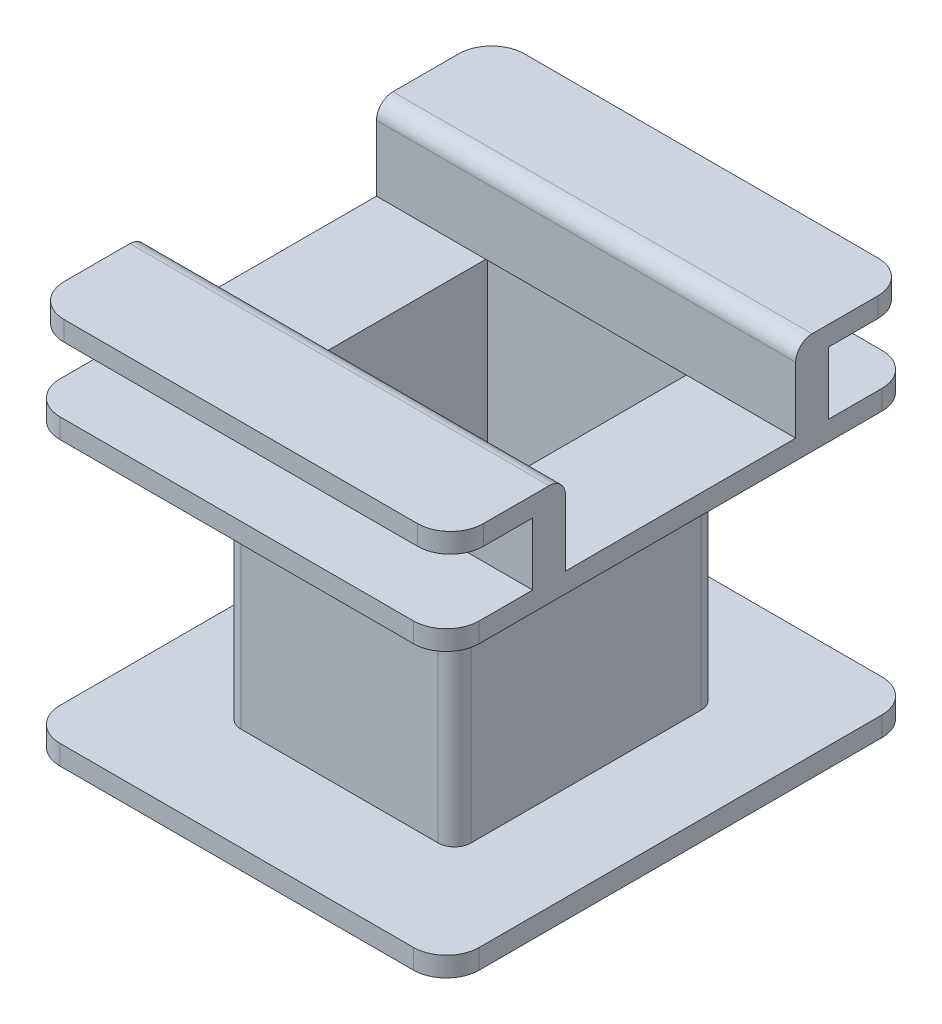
ISO-10303-21;
HEADER;
FILE_DESCRIPTION(('STEP AP214'),'2;1');
FILE_NAME('part.step','',(''),(''),'','','');
FILE_SCHEMA(('AUTOMOTIVE_DESIGN { 1 0 10303 214 1 1 1 1 }'));
ENDSEC;
DATA;
#1=APPLICATION_CONTEXT('core data for automotive mechanical design processes');
#2=APPLICATION_PROTOCOL_DEFINITION('international standard','automotive_design',2000,#1);
#3=PRODUCT_CONTEXT('',#1,'mechanical');
#4=PRODUCT('Part','Part','',(#3));
#5=PRODUCT_RELATED_PRODUCT_CATEGORY('part','',(#4));
#6=PRODUCT_DEFINITION_FORMATION('','',#4);
#7=PRODUCT_DEFINITION_CONTEXT('part definition',#1,'design');
#8=PRODUCT_DEFINITION('design','',#6,#7);
#9=PRODUCT_DEFINITION_SHAPE('','',#8);
#10=(LENGTH_UNIT() NAMED_UNIT(*) SI_UNIT(.MILLI.,.METRE.));
#11=(NAMED_UNIT(*) PLANE_ANGLE_UNIT() SI_UNIT($,.RADIAN.));
#12=(NAMED_UNIT(*) SI_UNIT($,.STERADIAN.) SOLID_ANGLE_UNIT());
#13=UNCERTAINTY_MEASURE_WITH_UNIT(LENGTH_MEASURE(1.E-05),#10,'distance_accuracy_value','');
#14=(GEOMETRIC_REPRESENTATION_CONTEXT(3) GLOBAL_UNCERTAINTY_ASSIGNED_CONTEXT((#13)) GLOBAL_UNIT_ASSIGNED_CONTEXT((#10,
#11,#12)) REPRESENTATION_CONTEXT('',''));
#15=CARTESIAN_POINT('',(0.,0.,0.));
#16=DIRECTION('',(0.,0.,1.));
#17=DIRECTION('',(1.,0.,0.));
#18=AXIS2_PLACEMENT_3D('',#15,#16,#17);
#19=CARTESIAN_POINT('',(-12.75,22.2,-8.99727731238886));
#20=DIRECTION('',(0.,0.,1.));
#21=DIRECTION('',(1.,0.,0.));
#22=AXIS2_PLACEMENT_3D('',#19,#20,#21);
#23=PLANE('',#22);
#24=DIRECTION('',(-1.,0.,0.));
#25=VECTOR('',#24,1.);
#26=CARTESIAN_POINT('',(12.75,21.,-8.99727731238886));
#27=LINE('',#26,#25);
#28=CARTESIAN_POINT('',(12.75,21.,-8.99727731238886));
#29=VERTEX_POINT('',#28);
#30=CARTESIAN_POINT('',(-12.75,21.,-8.99727731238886));
#31=VERTEX_POINT('',#30);
#32=EDGE_CURVE('E343',#29,#31,#27,.T.);
#33=ORIENTED_EDGE('',*,*,#32,.F.);
#34=DIRECTION('',(0.,-1.,0.));
#35=VECTOR('',#34,1.);
#36=CARTESIAN_POINT('',(12.75,22.2,-8.99727731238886));
#37=LINE('',#36,#35);
#38=CARTESIAN_POINT('',(12.75,17.2,-8.99727731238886));
#39=VERTEX_POINT('',#38);
#40=EDGE_CURVE('E356',#29,#39,#37,.T.);
#41=ORIENTED_EDGE('',*,*,#40,.T.);
#42=DIRECTION('',(-1.,0.,0.));
#43=VECTOR('',#42,1.);
#44=CARTESIAN_POINT('',(-12.75,17.2,-8.99727731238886));
#45=LINE('',#44,#43);
#46=CARTESIAN_POINT('',(-12.75,17.2,-8.99727731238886));
#47=VERTEX_POINT('',#46);
#48=EDGE_CURVE('E797',#39,#47,#45,.T.);
#49=ORIENTED_EDGE('',*,*,#48,.T.);
#50=DIRECTION('',(0.,-1.,0.));
#51=VECTOR('',#50,1.);
#52=CARTESIAN_POINT('',(-12.75,22.2,-8.99727731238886));
#53=LINE('',#52,#51);
#54=EDGE_CURVE('E358',#31,#47,#53,.T.);
#55=ORIENTED_EDGE('',*,*,#54,.F.);
#56=EDGE_LOOP('',(#33,#41,#49,#55));
#57=FACE_BOUND('',#56,.T.);
#58=ADVANCED_FACE('F35',(#57),#23,.F.);
#59=CARTESIAN_POINT('',(0.,17.2,0.));
#60=DIRECTION('',(0.,1.,0.));
#61=DIRECTION('',(0.,0.,1.));
#62=AXIS2_PLACEMENT_3D('',#59,#60,#61);
#63=PLANE('',#62);
#64=DIRECTION('',(0.,0.,-1.));
#65=VECTOR('',#64,1.);
#66=CARTESIAN_POINT('',(12.75,17.2,-14.25));
#67=LINE('',#66,#65);
#68=CARTESIAN_POINT('',(12.75,17.2,7.));
#69=VERTEX_POINT('',#68);
#70=CARTESIAN_POINT('',(12.75,17.2,-7.00000000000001));
#71=VERTEX_POINT('',#70);
#72=EDGE_CURVE('E467',#69,#71,#67,.T.);
#73=ORIENTED_EDGE('',*,*,#72,.T.);
#74=DIRECTION('',(1.,0.,0.));
#75=VECTOR('',#74,1.);
#76=CARTESIAN_POINT('',(-12.75,17.2,-7.));
#77=LINE('',#76,#75);
#78=CARTESIAN_POINT('',(6.1,17.2,-7.));
#79=VERTEX_POINT('',#78);
#80=EDGE_CURVE('E351',#79,#71,#77,.T.);
#81=ORIENTED_EDGE('',*,*,#80,.F.);
#82=DIRECTION('',(0.,0.,1.));
#83=VECTOR('',#82,1.);
#84=CARTESIAN_POINT('',(6.1,17.2,7.1));
#85=LINE('',#84,#83);
#86=CARTESIAN_POINT('',(6.1,17.2,7.));
#87=VERTEX_POINT('',#86);
#88=EDGE_CURVE('E416',#79,#87,#85,.T.);
#89=ORIENTED_EDGE('',*,*,#88,.T.);
#90=DIRECTION('',(-1.,0.,0.));
#91=VECTOR('',#90,1.);
#92=CARTESIAN_POINT('',(-12.75,17.2,7.));
#93=LINE('',#92,#91);
#94=EDGE_CURVE('E394',#69,#87,#93,.T.);
#95=ORIENTED_EDGE('',*,*,#94,.F.);
#96=EDGE_LOOP('',(#73,#81,#89,#95));
#97=FACE_BOUND('',#96,.T.);
#98=ADVANCED_FACE('F761',(#97),#63,.T.);
#99=DIRECTION('',(0.,0.,-1.));
#100=VECTOR('',#99,1.);
#101=CARTESIAN_POINT('',(-6.1,17.2,7.1));
#102=LINE('',#101,#100);
#103=CARTESIAN_POINT('',(-6.1,17.2,7.));
#104=VERTEX_POINT('',#103);
#105=CARTESIAN_POINT('',(-6.1,17.2,-7.));
#106=VERTEX_POINT('',#105);
#107=EDGE_CURVE('E419',#104,#106,#102,.T.);
#108=ORIENTED_EDGE('',*,*,#107,.T.);
#109=CARTESIAN_POINT('',(-12.75,17.2,-7.00000000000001));
#110=VERTEX_POINT('',#109);
#111=EDGE_CURVE('E720',#110,#106,#77,.T.);
#112=ORIENTED_EDGE('',*,*,#111,.F.);
#113=DIRECTION('',(0.,0.,1.));
#114=VECTOR('',#113,1.);
#115=CARTESIAN_POINT('',(-12.75,17.2,-14.25));
#116=LINE('',#115,#114);
#117=CARTESIAN_POINT('',(-12.75,17.2,7.));
#118=VERTEX_POINT('',#117);
#119=EDGE_CURVE('E475',#110,#118,#116,.T.);
#120=ORIENTED_EDGE('',*,*,#119,.T.);
#121=EDGE_CURVE('E403',#104,#118,#93,.T.);
#122=ORIENTED_EDGE('',*,*,#121,.F.);
#123=EDGE_LOOP('',(#108,#112,#120,#122));
#124=FACE_BOUND('',#123,.T.);
#125=ADVANCED_FACE('F717',(#124),#63,.T.);
#126=CARTESIAN_POINT('',(-12.75,17.2,-12.25));
#127=VERTEX_POINT('',#126);
#128=EDGE_CURVE('E471',#127,#47,#116,.T.);
#129=ORIENTED_EDGE('',*,*,#128,.T.);
#130=ORIENTED_EDGE('',*,*,#48,.F.);
#131=CARTESIAN_POINT('',(12.75,17.2,-12.25));
#132=VERTEX_POINT('',#131);
#133=EDGE_CURVE('E365',#39,#132,#67,.T.);
#134=ORIENTED_EDGE('',*,*,#133,.T.);
#135=CARTESIAN_POINT('',(10.75,17.2,-12.25));
#136=DIRECTION('',(0.,1.,0.));
#137=DIRECTION('',(0.,0.,1.));
#138=AXIS2_PLACEMENT_3D('',#135,#136,#137);
#139=CIRCLE('',#138,2.);
#140=CARTESIAN_POINT('',(10.75,17.2,-14.25));
#141=VERTEX_POINT('',#140);
#142=EDGE_CURVE('E586',#132,#141,#139,.T.);
#143=ORIENTED_EDGE('',*,*,#142,.T.);
#144=DIRECTION('',(-1.,0.,0.));
#145=VECTOR('',#144,1.);
#146=CARTESIAN_POINT('',(-12.75,17.2,-14.25));
#147=LINE('',#146,#145);
#148=CARTESIAN_POINT('',(-10.75,17.2,-14.25));
#149=VERTEX_POINT('',#148);
#150=EDGE_CURVE('E466',#141,#149,#147,.T.);
#151=ORIENTED_EDGE('',*,*,#150,.T.);
#152=CARTESIAN_POINT('',(-10.75,17.2,-12.25));
#153=DIRECTION('',(0.,1.,0.));
#154=DIRECTION('',(0.,0.,1.));
#155=AXIS2_PLACEMENT_3D('',#152,#153,#154);
#156=CIRCLE('',#155,2.);
#157=EDGE_CURVE('E582',#149,#127,#156,.T.);
#158=ORIENTED_EDGE('',*,*,#157,.T.);
#159=EDGE_LOOP('',(#129,#130,#134,#143,#151,#158));
#160=FACE_BOUND('',#159,.T.);
#161=ADVANCED_FACE('F813',(#160),#63,.T.);
#162=CARTESIAN_POINT('',(-12.75,22.2,8.99894490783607));
#163=DIRECTION('',(0.,0.,-1.));
#164=DIRECTION('',(-1.,0.,0.));
#165=AXIS2_PLACEMENT_3D('',#162,#163,#164);
#166=PLANE('',#165);
#167=DIRECTION('',(1.,0.,0.));
#168=VECTOR('',#167,1.);
#169=CARTESIAN_POINT('',(-12.75,21.,8.99894490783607));
#170=LINE('',#169,#168);
#171=CARTESIAN_POINT('',(-12.75,21.,8.99894490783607));
#172=VERTEX_POINT('',#171);
#173=CARTESIAN_POINT('',(12.75,21.,8.99894490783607));
#174=VERTEX_POINT('',#173);
#175=EDGE_CURVE('E377',#172,#174,#170,.T.);
#176=ORIENTED_EDGE('',*,*,#175,.F.);
#177=DIRECTION('',(0.,-1.,0.));
#178=VECTOR('',#177,1.);
#179=CARTESIAN_POINT('',(-12.75,22.2,8.99894490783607));
#180=LINE('',#179,#178);
#181=CARTESIAN_POINT('',(-12.75,17.2,8.99894490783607));
#182=VERTEX_POINT('',#181);
#183=EDGE_CURVE('E409',#172,#182,#180,.T.);
#184=ORIENTED_EDGE('',*,*,#183,.T.);
#185=DIRECTION('',(1.,0.,0.));
#186=VECTOR('',#185,1.);
#187=CARTESIAN_POINT('',(-12.75,17.2,8.99894490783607));
#188=LINE('',#187,#186);
#189=CARTESIAN_POINT('',(12.75,17.2,8.99894490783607));
#190=VERTEX_POINT('',#189);
#191=EDGE_CURVE('E390',#182,#190,#188,.T.);
#192=ORIENTED_EDGE('',*,*,#191,.T.);
#193=DIRECTION('',(0.,-1.,0.));
#194=VECTOR('',#193,1.);
#195=CARTESIAN_POINT('',(12.75,22.2,8.99894490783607));
#196=LINE('',#195,#194);
#197=EDGE_CURVE('E407',#174,#190,#196,.T.);
#198=ORIENTED_EDGE('',*,*,#197,.F.);
#199=EDGE_LOOP('',(#176,#184,#192,#198));
#200=FACE_BOUND('',#199,.T.);
#201=ADVANCED_FACE('F749',(#200),#166,.F.);
#202=CARTESIAN_POINT('',(7.,16.,-8.));
#203=DIRECTION('',(-1.,0.,0.));
#204=DIRECTION('',(0.,0.,1.));
#205=AXIS2_PLACEMENT_3D('',#202,#203,#204);
#206=PLANE('',#205);
#207=DIRECTION('',(0.,0.,-1.));
#208=VECTOR('',#207,1.);
#209=CARTESIAN_POINT('',(7.,0.,-8.));
#210=LINE('',#209,#208);
#211=CARTESIAN_POINT('',(7.,0.,7.));
#212=VERTEX_POINT('',#211);
#213=CARTESIAN_POINT('',(7.,0.,-7.));
#214=VERTEX_POINT('',#213);
#215=EDGE_CURVE('E492',#212,#214,#210,.T.);
#216=ORIENTED_EDGE('',*,*,#215,.T.);
#217=DIRECTION('',(0.,-1.,0.));
#218=VECTOR('',#217,1.);
#219=CARTESIAN_POINT('',(7.,16.,-7.));
#220=LINE('',#219,#218);
#221=CARTESIAN_POINT('',(7.,16.,-7.));
#222=VERTEX_POINT('',#221);
#223=EDGE_CURVE('E560',#214,#222,#220,.F.);
#224=ORIENTED_EDGE('',*,*,#223,.T.);
#225=DIRECTION('',(0.,0.,-1.));
#226=VECTOR('',#225,1.);
#227=CARTESIAN_POINT('',(7.,16.,-8.));
#228=LINE('',#227,#226);
#229=CARTESIAN_POINT('',(7.,16.,7.));
#230=VERTEX_POINT('',#229);
#231=EDGE_CURVE('E498',#230,#222,#228,.T.);
#232=ORIENTED_EDGE('',*,*,#231,.F.);
#233=DIRECTION('',(0.,-1.,0.));
#234=VECTOR('',#233,1.);
#235=CARTESIAN_POINT('',(7.,16.,7.));
#236=LINE('',#235,#234);
#237=EDGE_CURVE('E557',#230,#212,#236,.T.);
#238=ORIENTED_EDGE('',*,*,#237,.T.);
#239=EDGE_LOOP('',(#216,#224,#232,#238));
#240=FACE_BOUND('',#239,.T.);
#241=ADVANCED_FACE('F1038',(#240),#206,.F.);
#242=CARTESIAN_POINT('',(-7.,16.,-8.));
#243=DIRECTION('',(0.,0.,1.));
#244=DIRECTION('',(1.,0.,0.));
#245=AXIS2_PLACEMENT_3D('',#242,#243,#244);
#246=PLANE('',#245);
#247=DIRECTION('',(-1.,0.,0.));
#248=VECTOR('',#247,1.);
#249=CARTESIAN_POINT('',(-7.,0.,-8.));
#250=LINE('',#249,#248);
#251=CARTESIAN_POINT('',(6.,0.,-8.));
#252=VERTEX_POINT('',#251);
#253=CARTESIAN_POINT('',(-6.,0.,-8.));
#254=VERTEX_POINT('',#253);
#255=EDGE_CURVE('E513',#252,#254,#250,.T.);
#256=ORIENTED_EDGE('',*,*,#255,.T.);
#257=DIRECTION('',(0.,-1.,0.));
#258=VECTOR('',#257,1.);
#259=CARTESIAN_POINT('',(-6.,16.,-8.));
#260=LINE('',#259,#258);
#261=CARTESIAN_POINT('',(-6.,16.,-8.));
#262=VERTEX_POINT('',#261);
#263=EDGE_CURVE('E538',#254,#262,#260,.F.);
#264=ORIENTED_EDGE('',*,*,#263,.T.);
#265=DIRECTION('',(-1.,0.,0.));
#266=VECTOR('',#265,1.);
#267=CARTESIAN_POINT('',(-7.,16.,-8.));
#268=LINE('',#267,#266);
#269=CARTESIAN_POINT('',(6.,16.,-8.));
#270=VERTEX_POINT('',#269);
#271=EDGE_CURVE('E501',#270,#262,#268,.T.);
#272=ORIENTED_EDGE('',*,*,#271,.F.);
#273=DIRECTION('',(0.,-1.,0.));
#274=VECTOR('',#273,1.);
#275=CARTESIAN_POINT('',(6.,16.,-8.));
#276=LINE('',#275,#274);
#277=EDGE_CURVE('E535',#270,#252,#276,.T.);
#278=ORIENTED_EDGE('',*,*,#277,.T.);
#279=EDGE_LOOP('',(#256,#264,#272,#278));
#280=FACE_BOUND('',#279,.T.);
#281=ADVANCED_FACE('F1223',(#280),#246,.F.);
#282=CARTESIAN_POINT('',(-7.,16.,-8.));
#283=DIRECTION('',(1.,0.,0.));
#284=DIRECTION('',(0.,0.,-1.));
#285=AXIS2_PLACEMENT_3D('',#282,#283,#284);
#286=PLANE('',#285);
#287=DIRECTION('',(0.,0.,1.));
#288=VECTOR('',#287,1.);
#289=CARTESIAN_POINT('',(-7.,16.,-8.));
#290=LINE('',#289,#288);
#291=CARTESIAN_POINT('',(-7.,16.,-7.));
#292=VERTEX_POINT('',#291);
#293=CARTESIAN_POINT('',(-7.,16.,7.));
#294=VERTEX_POINT('',#293);
#295=EDGE_CURVE('E505',#292,#294,#290,.T.);
#296=ORIENTED_EDGE('',*,*,#295,.F.);
#297=DIRECTION('',(0.,-1.,0.));
#298=VECTOR('',#297,1.);
#299=CARTESIAN_POINT('',(-7.,16.,-7.));
#300=LINE('',#299,#298);
#301=CARTESIAN_POINT('',(-7.,0.,-7.));
#302=VERTEX_POINT('',#301);
#303=EDGE_CURVE('E520',#292,#302,#300,.T.);
#304=ORIENTED_EDGE('',*,*,#303,.T.);
#305=DIRECTION('',(0.,0.,1.));
#306=VECTOR('',#305,1.);
#307=CARTESIAN_POINT('',(-7.,0.,-8.));
#308=LINE('',#307,#306);
#309=CARTESIAN_POINT('',(-7.,0.,7.));
#310=VERTEX_POINT('',#309);
#311=EDGE_CURVE('E515',#302,#310,#308,.T.);
#312=ORIENTED_EDGE('',*,*,#311,.T.);
#313=DIRECTION('',(0.,-1.,0.));
#314=VECTOR('',#313,1.);
#315=CARTESIAN_POINT('',(-7.,16.,7.));
#316=LINE('',#315,#314);
#317=EDGE_CURVE('E511',#310,#294,#316,.F.);
#318=ORIENTED_EDGE('',*,*,#317,.T.);
#319=EDGE_LOOP('',(#296,#304,#312,#318));
#320=FACE_BOUND('',#319,.T.);
#321=ADVANCED_FACE('F1213',(#320),#286,.F.);
#322=CARTESIAN_POINT('',(-7.,16.,8.));
#323=DIRECTION('',(0.,0.,-1.));
#324=DIRECTION('',(-1.,0.,0.));
#325=AXIS2_PLACEMENT_3D('',#322,#323,#324);
#326=PLANE('',#325);
#327=DIRECTION('',(1.,0.,0.));
#328=VECTOR('',#327,1.);
#329=CARTESIAN_POINT('',(-7.,16.,8.));
#330=LINE('',#329,#328);
#331=CARTESIAN_POINT('',(-6.,16.,8.));
#332=VERTEX_POINT('',#331);
#333=CARTESIAN_POINT('',(6.,16.,8.));
#334=VERTEX_POINT('',#333);
#335=EDGE_CURVE('E508',#332,#334,#330,.T.);
#336=ORIENTED_EDGE('',*,*,#335,.F.);
#337=DIRECTION('',(0.,-1.,0.));
#338=VECTOR('',#337,1.);
#339=CARTESIAN_POINT('',(-6.,16.,8.));
#340=LINE('',#339,#338);
#341=CARTESIAN_POINT('',(-6.,0.,8.));
#342=VERTEX_POINT('',#341);
#343=EDGE_CURVE('E554',#332,#342,#340,.T.);
#344=ORIENTED_EDGE('',*,*,#343,.T.);
#345=DIRECTION('',(1.,0.,0.));
#346=VECTOR('',#345,1.);
#347=CARTESIAN_POINT('',(-7.,0.,8.));
#348=LINE('',#347,#346);
#349=CARTESIAN_POINT('',(6.,0.,8.));
#350=VERTEX_POINT('',#349);
#351=EDGE_CURVE('E502',#342,#350,#348,.T.);
#352=ORIENTED_EDGE('',*,*,#351,.T.);
#353=DIRECTION('',(0.,-1.,0.));
#354=VECTOR('',#353,1.);
#355=CARTESIAN_POINT('',(6.,16.,8.));
#356=LINE('',#355,#354);
#357=EDGE_CURVE('E552',#350,#334,#356,.F.);
#358=ORIENTED_EDGE('',*,*,#357,.T.);
#359=EDGE_LOOP('',(#336,#344,#352,#358));
#360=FACE_BOUND('',#359,.T.);
#361=ADVANCED_FACE('F1203',(#360),#326,.F.);
#362=CARTESIAN_POINT('',(-6.,16.,-7.));
#363=DIRECTION('',(0.,-1.,0.));
#364=DIRECTION('',(0.,0.,-1.));
#365=AXIS2_PLACEMENT_3D('',#362,#363,#364);
#366=CYLINDRICAL_SURFACE('',#365,1.);
#367=CARTESIAN_POINT('',(-6.,16.,-7.));
#368=DIRECTION('',(0.,1.,0.));
#369=DIRECTION('',(0.,0.,1.));
#370=AXIS2_PLACEMENT_3D('',#367,#368,#369);
#371=CIRCLE('',#370,1.);
#372=EDGE_CURVE('E549',#262,#292,#371,.T.);
#373=ORIENTED_EDGE('',*,*,#372,.F.);
#374=ORIENTED_EDGE('',*,*,#263,.F.);
#375=CARTESIAN_POINT('',(-6.,0.,-7.));
#376=DIRECTION('',(0.,1.,0.));
#377=DIRECTION('',(0.,0.,1.));
#378=AXIS2_PLACEMENT_3D('',#375,#376,#377);
#379=CIRCLE('',#378,1.);
#380=EDGE_CURVE('E532',#302,#254,#379,.F.);
#381=ORIENTED_EDGE('',*,*,#380,.F.);
#382=ORIENTED_EDGE('',*,*,#303,.F.);
#383=EDGE_LOOP('',(#373,#374,#381,#382));
#384=FACE_BOUND('',#383,.T.);
#385=ADVANCED_FACE('F1193',(#384),#366,.T.);
#386=CARTESIAN_POINT('',(-6.,16.,7.));
#387=DIRECTION('',(0.,-1.,0.));
#388=DIRECTION('',(0.,0.,-1.));
#389=AXIS2_PLACEMENT_3D('',#386,#387,#388);
#390=CYLINDRICAL_SURFACE('',#389,1.);
#391=CARTESIAN_POINT('',(-6.,16.,7.));
#392=DIRECTION('',(0.,1.,0.));
#393=DIRECTION('',(0.,0.,1.));
#394=AXIS2_PLACEMENT_3D('',#391,#392,#393);
#395=CIRCLE('',#394,1.);
#396=EDGE_CURVE('E546',#294,#332,#395,.T.);
#397=ORIENTED_EDGE('',*,*,#396,.F.);
#398=ORIENTED_EDGE('',*,*,#317,.F.);
#399=CARTESIAN_POINT('',(-6.,0.,7.));
#400=DIRECTION('',(0.,1.,0.));
#401=DIRECTION('',(0.,0.,1.));
#402=AXIS2_PLACEMENT_3D('',#399,#400,#401);
#403=CIRCLE('',#402,1.);
#404=EDGE_CURVE('E529',#342,#310,#403,.F.);
#405=ORIENTED_EDGE('',*,*,#404,.F.);
#406=ORIENTED_EDGE('',*,*,#343,.F.);
#407=EDGE_LOOP('',(#397,#398,#405,#406));
#408=FACE_BOUND('',#407,.T.);
#409=ADVANCED_FACE('F1183',(#408),#390,.T.);
#410=CARTESIAN_POINT('',(6.,16.,-7.));
#411=DIRECTION('',(0.,-1.,0.));
#412=DIRECTION('',(0.,0.,-1.));
#413=AXIS2_PLACEMENT_3D('',#410,#411,#412);
#414=CYLINDRICAL_SURFACE('',#413,1.);
#415=CARTESIAN_POINT('',(6.,16.,-7.));
#416=DIRECTION('',(0.,1.,0.));
#417=DIRECTION('',(0.,0.,1.));
#418=AXIS2_PLACEMENT_3D('',#415,#416,#417);
#419=CIRCLE('',#418,1.);
#420=EDGE_CURVE('E543',#222,#270,#419,.T.);
#421=ORIENTED_EDGE('',*,*,#420,.F.);
#422=ORIENTED_EDGE('',*,*,#223,.F.);
#423=CARTESIAN_POINT('',(6.,0.,-7.));
#424=DIRECTION('',(0.,1.,0.));
#425=DIRECTION('',(0.,0.,1.));
#426=AXIS2_PLACEMENT_3D('',#423,#424,#425);
#427=CIRCLE('',#426,1.);
#428=EDGE_CURVE('E526',#252,#214,#427,.F.);
#429=ORIENTED_EDGE('',*,*,#428,.F.);
#430=ORIENTED_EDGE('',*,*,#277,.F.);
#431=EDGE_LOOP('',(#421,#422,#429,#430));
#432=FACE_BOUND('',#431,.T.);
#433=ADVANCED_FACE('F1173',(#432),#414,.T.);
#434=CARTESIAN_POINT('',(6.,16.,7.));
#435=DIRECTION('',(0.,-1.,0.));
#436=DIRECTION('',(0.,0.,-1.));
#437=AXIS2_PLACEMENT_3D('',#434,#435,#436);
#438=CYLINDRICAL_SURFACE('',#437,1.);
#439=CARTESIAN_POINT('',(6.,16.,7.));
#440=DIRECTION('',(0.,1.,0.));
#441=DIRECTION('',(0.,0.,1.));
#442=AXIS2_PLACEMENT_3D('',#439,#440,#441);
#443=CIRCLE('',#442,1.);
#444=EDGE_CURVE('E540',#334,#230,#443,.T.);
#445=ORIENTED_EDGE('',*,*,#444,.F.);
#446=ORIENTED_EDGE('',*,*,#357,.F.);
#447=CARTESIAN_POINT('',(6.,0.,7.));
#448=DIRECTION('',(0.,1.,0.));
#449=DIRECTION('',(0.,0.,1.));
#450=AXIS2_PLACEMENT_3D('',#447,#448,#449);
#451=CIRCLE('',#450,1.);
#452=EDGE_CURVE('E523',#212,#350,#451,.F.);
#453=ORIENTED_EDGE('',*,*,#452,.F.);
#454=ORIENTED_EDGE('',*,*,#237,.F.);
#455=EDGE_LOOP('',(#445,#446,#453,#454));
#456=FACE_BOUND('',#455,.T.);
#457=ADVANCED_FACE('F916',(#456),#438,.T.);
#458=CARTESIAN_POINT('',(12.75,17.2,-14.25));
#459=DIRECTION('',(-1.,0.,0.));
#460=DIRECTION('',(0.,0.,1.));
#461=AXIS2_PLACEMENT_3D('',#458,#459,#460);
#462=PLANE('',#461);
#463=DIRECTION('',(0.,0.,-1.));
#464=VECTOR('',#463,1.);
#465=CARTESIAN_POINT('',(12.75,22.2,-7.));
#466=LINE('',#465,#464);
#467=CARTESIAN_POINT('',(12.75,22.2,-8.));
#468=VERTEX_POINT('',#467);
#469=CARTESIAN_POINT('',(12.75,22.2,-11.9972773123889));
#470=VERTEX_POINT('',#469);
#471=EDGE_CURVE('E370',#468,#470,#466,.T.);
#472=ORIENTED_EDGE('',*,*,#471,.F.);
#473=CARTESIAN_POINT('',(12.75,21.2,-8.));
#474=DIRECTION('',(-1.,0.,0.));
#475=DIRECTION('',(0.,0.,1.));
#476=AXIS2_PLACEMENT_3D('',#473,#474,#475);
#477=CIRCLE('',#476,1.);
#478=CARTESIAN_POINT('',(12.75,21.2,-7.));
#479=VERTEX_POINT('',#478);
#480=EDGE_CURVE('E676',#468,#479,#477,.F.);
#481=ORIENTED_EDGE('',*,*,#480,.T.);
#482=DIRECTION('',(0.,-1.,0.));
#483=VECTOR('',#482,1.);
#484=CARTESIAN_POINT('',(12.75,22.2,-7.));
#485=LINE('',#484,#483);
#486=EDGE_CURVE('E366',#479,#71,#485,.T.);
#487=ORIENTED_EDGE('',*,*,#486,.T.);
#488=ORIENTED_EDGE('',*,*,#72,.F.);
#489=DIRECTION('',(0.,-1.,0.));
#490=VECTOR('',#489,1.);
#491=CARTESIAN_POINT('',(12.75,22.2,7.));
#492=LINE('',#491,#490);
#493=CARTESIAN_POINT('',(12.75,21.2,7.));
#494=VERTEX_POINT('',#493);
#495=EDGE_CURVE('E405',#494,#69,#492,.T.);
#496=ORIENTED_EDGE('',*,*,#495,.F.);
#497=CARTESIAN_POINT('',(12.75,21.2,8.));
#498=DIRECTION('',(-1.,0.,0.));
#499=DIRECTION('',(0.,0.,1.));
#500=AXIS2_PLACEMENT_3D('',#497,#498,#499);
#501=CIRCLE('',#500,1.);
#502=CARTESIAN_POINT('',(12.75,22.2,8.));
#503=VERTEX_POINT('',#502);
#504=EDGE_CURVE('E674',#494,#503,#501,.F.);
#505=ORIENTED_EDGE('',*,*,#504,.T.);
#506=DIRECTION('',(0.,0.,-1.));
#507=VECTOR('',#506,1.);
#508=CARTESIAN_POINT('',(12.75,22.2,7.));
#509=LINE('',#508,#507);
#510=CARTESIAN_POINT('',(12.75,22.2,11.9989449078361));
#511=VERTEX_POINT('',#510);
#512=EDGE_CURVE('E393',#511,#503,#509,.T.);
#513=ORIENTED_EDGE('',*,*,#512,.F.);
#514=DIRECTION('',(0.,1.,0.));
#515=VECTOR('',#514,1.);
#516=CARTESIAN_POINT('',(12.75,21.,11.9989449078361));
#517=LINE('',#516,#515);
#518=CARTESIAN_POINT('',(12.75,21.,11.9989449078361));
#519=VERTEX_POINT('',#518);
#520=EDGE_CURVE('E652',#511,#519,#517,.F.);
#521=ORIENTED_EDGE('',*,*,#520,.T.);
#522=DIRECTION('',(0.,0.,-1.));
#523=VECTOR('',#522,1.);
#524=CARTESIAN_POINT('',(12.75,21.,13.9989449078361));
#525=LINE('',#524,#523);
#526=EDGE_CURVE('E384',#519,#174,#525,.T.);
#527=ORIENTED_EDGE('',*,*,#526,.T.);
#528=ORIENTED_EDGE('',*,*,#197,.T.);
#529=CARTESIAN_POINT('',(12.75,17.2,12.25));
#530=VERTEX_POINT('',#529);
#531=EDGE_CURVE('E463',#530,#190,#67,.T.);
#532=ORIENTED_EDGE('',*,*,#531,.F.);
#533=DIRECTION('',(0.,-1.,0.));
#534=VECTOR('',#533,1.);
#535=CARTESIAN_POINT('',(12.75,17.2,12.25));
#536=LINE('',#535,#534);
#537=CARTESIAN_POINT('',(12.75,16.,12.25));
#538=VERTEX_POINT('',#537);
#539=EDGE_CURVE('E575',#530,#538,#536,.T.);
#540=ORIENTED_EDGE('',*,*,#539,.T.);
#541=DIRECTION('',(0.,0.,-1.));
#542=VECTOR('',#541,1.);
#543=CARTESIAN_POINT('',(12.75,16.,-14.25));
#544=LINE('',#543,#542);
#545=CARTESIAN_POINT('',(12.75,16.,-12.25));
#546=VERTEX_POINT('',#545);
#547=EDGE_CURVE('E452',#538,#546,#544,.T.);
#548=ORIENTED_EDGE('',*,*,#547,.T.);
#549=DIRECTION('',(0.,-1.,0.));
#550=VECTOR('',#549,1.);
#551=CARTESIAN_POINT('',(12.75,17.2,-12.25));
#552=LINE('',#551,#550);
#553=EDGE_CURVE('E578',#546,#132,#552,.F.);
#554=ORIENTED_EDGE('',*,*,#553,.T.);
#555=ORIENTED_EDGE('',*,*,#133,.F.);
#556=ORIENTED_EDGE('',*,*,#40,.F.);
#557=DIRECTION('',(0.,0.,1.));
#558=VECTOR('',#557,1.);
#559=CARTESIAN_POINT('',(12.75,21.,-13.9972773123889));
#560=LINE('',#559,#558);
#561=CARTESIAN_POINT('',(12.75,21.,-11.9972773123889));
#562=VERTEX_POINT('',#561);
#563=EDGE_CURVE('E339',#562,#29,#560,.T.);
#564=ORIENTED_EDGE('',*,*,#563,.F.);
#565=DIRECTION('',(0.,-1.,0.));
#566=VECTOR('',#565,1.);
#567=CARTESIAN_POINT('',(12.75,22.2,-11.9972773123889));
#568=LINE('',#567,#566);
#569=EDGE_CURVE('E669',#562,#470,#568,.F.);
#570=ORIENTED_EDGE('',*,*,#569,.T.);
#571=EDGE_LOOP('',(#472,#481,#487,#488,#496,#505,#513,#521,#527,#528,#532,#540,#548,#554,#555,
#556,#564,#570));
#572=FACE_BOUND('',#571,.T.);
#573=ADVANCED_FACE('F363',(#572),#462,.F.);
#574=CARTESIAN_POINT('',(-12.75,17.2,-14.25));
#575=DIRECTION('',(0.,0.,1.));
#576=DIRECTION('',(1.,0.,0.));
#577=AXIS2_PLACEMENT_3D('',#574,#575,#576);
#578=PLANE('',#577);
#579=ORIENTED_EDGE('',*,*,#150,.F.);
#580=DIRECTION('',(0.,-1.,0.));
#581=VECTOR('',#580,1.);
#582=CARTESIAN_POINT('',(10.75,17.2,-14.25));
#583=LINE('',#582,#581);
#584=CARTESIAN_POINT('',(10.75,16.,-14.25));
#585=VERTEX_POINT('',#584);
#586=EDGE_CURVE('E564',#141,#585,#583,.T.);
#587=ORIENTED_EDGE('',*,*,#586,.T.);
#588=DIRECTION('',(-1.,0.,0.));
#589=VECTOR('',#588,1.);
#590=CARTESIAN_POINT('',(-12.75,16.,-14.25));
#591=LINE('',#590,#589);
#592=CARTESIAN_POINT('',(-10.75,16.,-14.25));
#593=VERTEX_POINT('',#592);
#594=EDGE_CURVE('E481',#585,#593,#591,.T.);
#595=ORIENTED_EDGE('',*,*,#594,.T.);
#596=DIRECTION('',(0.,-1.,0.));
#597=VECTOR('',#596,1.);
#598=CARTESIAN_POINT('',(-10.75,17.2,-14.25));
#599=LINE('',#598,#597);
#600=EDGE_CURVE('E562',#593,#149,#599,.F.);
#601=ORIENTED_EDGE('',*,*,#600,.T.);
#602=EDGE_LOOP('',(#579,#587,#595,#601));
#603=FACE_BOUND('',#602,.T.);
#604=ADVANCED_FACE('F820',(#603),#578,.F.);
#605=CARTESIAN_POINT('',(-12.75,17.2,-14.25));
#606=DIRECTION('',(1.,0.,0.));
#607=DIRECTION('',(0.,0.,-1.));
#608=AXIS2_PLACEMENT_3D('',#605,#606,#607);
#609=PLANE('',#608);
#610=DIRECTION('',(0.,-1.,0.));
#611=VECTOR('',#610,1.);
#612=CARTESIAN_POINT('',(-12.75,22.2,-7.));
#613=LINE('',#612,#611);
#614=CARTESIAN_POINT('',(-12.75,21.2,-7.));
#615=VERTEX_POINT('',#614);
#616=EDGE_CURVE('E368',#615,#110,#613,.T.);
#617=ORIENTED_EDGE('',*,*,#616,.F.);
#618=CARTESIAN_POINT('',(-12.75,21.2,-8.));
#619=DIRECTION('',(1.,0.,0.));
#620=DIRECTION('',(0.,0.,-1.));
#621=AXIS2_PLACEMENT_3D('',#618,#619,#620);
#622=CIRCLE('',#621,1.);
#623=CARTESIAN_POINT('',(-12.75,22.2,-8.));
#624=VERTEX_POINT('',#623);
#625=EDGE_CURVE('E681',#615,#624,#622,.F.);
#626=ORIENTED_EDGE('',*,*,#625,.T.);
#627=DIRECTION('',(0.,0.,1.));
#628=VECTOR('',#627,1.);
#629=CARTESIAN_POINT('',(-12.75,22.2,-7.));
#630=LINE('',#629,#628);
#631=CARTESIAN_POINT('',(-12.75,22.2,-11.9972773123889));
#632=VERTEX_POINT('',#631);
#633=EDGE_CURVE('E794',#632,#624,#630,.T.);
#634=ORIENTED_EDGE('',*,*,#633,.F.);
#635=DIRECTION('',(0.,1.,0.));
#636=VECTOR('',#635,1.);
#637=CARTESIAN_POINT('',(-12.75,21.,-11.9972773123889));
#638=LINE('',#637,#636);
#639=CARTESIAN_POINT('',(-12.75,21.,-11.9972773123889));
#640=VERTEX_POINT('',#639);
#641=EDGE_CURVE('E664',#632,#640,#638,.F.);
#642=ORIENTED_EDGE('',*,*,#641,.T.);
#643=DIRECTION('',(0.,0.,1.));
#644=VECTOR('',#643,1.);
#645=CARTESIAN_POINT('',(-12.75,21.,-13.9972773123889));
#646=LINE('',#645,#644);
#647=EDGE_CURVE('E352',#640,#31,#646,.T.);
#648=ORIENTED_EDGE('',*,*,#647,.T.);
#649=ORIENTED_EDGE('',*,*,#54,.T.);
#650=ORIENTED_EDGE('',*,*,#128,.F.);
#651=DIRECTION('',(0.,-1.,0.));
#652=VECTOR('',#651,1.);
#653=CARTESIAN_POINT('',(-12.75,17.2,-12.25));
#654=LINE('',#653,#652);
#655=CARTESIAN_POINT('',(-12.75,16.,-12.25));
#656=VERTEX_POINT('',#655);
#657=EDGE_CURVE('E596',#127,#656,#654,.T.);
#658=ORIENTED_EDGE('',*,*,#657,.T.);
#659=DIRECTION('',(0.,0.,1.));
#660=VECTOR('',#659,1.);
#661=CARTESIAN_POINT('',(-12.75,16.,-14.25));
#662=LINE('',#661,#660);
#663=CARTESIAN_POINT('',(-12.75,16.,12.25));
#664=VERTEX_POINT('',#663);
#665=EDGE_CURVE('E484',#656,#664,#662,.T.);
#666=ORIENTED_EDGE('',*,*,#665,.T.);
#667=DIRECTION('',(0.,-1.,0.));
#668=VECTOR('',#667,1.);
#669=CARTESIAN_POINT('',(-12.75,17.2,12.25));
#670=LINE('',#669,#668);
#671=CARTESIAN_POINT('',(-12.75,17.2,12.25));
#672=VERTEX_POINT('',#671);
#673=EDGE_CURVE('E593',#664,#672,#670,.F.);
#674=ORIENTED_EDGE('',*,*,#673,.T.);
#675=EDGE_CURVE('E470',#182,#672,#116,.T.);
#676=ORIENTED_EDGE('',*,*,#675,.F.);
#677=ORIENTED_EDGE('',*,*,#183,.F.);
#678=DIRECTION('',(0.,0.,-1.));
#679=VECTOR('',#678,1.);
#680=CARTESIAN_POINT('',(-12.75,21.,13.9989449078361));
#681=LINE('',#680,#679);
#682=CARTESIAN_POINT('',(-12.75,21.,11.9989449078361));
#683=VERTEX_POINT('',#682);
#684=EDGE_CURVE('E388',#683,#172,#681,.T.);
#685=ORIENTED_EDGE('',*,*,#684,.F.);
#686=DIRECTION('',(0.,-1.,0.));
#687=VECTOR('',#686,1.);
#688=CARTESIAN_POINT('',(-12.75,22.2,11.9989449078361));
#689=LINE('',#688,#687);
#690=CARTESIAN_POINT('',(-12.75,22.2,11.9989449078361));
#691=VERTEX_POINT('',#690);
#692=EDGE_CURVE('E645',#683,#691,#689,.F.);
#693=ORIENTED_EDGE('',*,*,#692,.T.);
#694=DIRECTION('',(0.,0.,1.));
#695=VECTOR('',#694,1.);
#696=CARTESIAN_POINT('',(-12.75,22.2,7.));
#697=LINE('',#696,#695);
#698=CARTESIAN_POINT('',(-12.75,22.2,8.));
#699=VERTEX_POINT('',#698);
#700=EDGE_CURVE('E391',#699,#691,#697,.T.);
#701=ORIENTED_EDGE('',*,*,#700,.F.);
#702=CARTESIAN_POINT('',(-12.75,21.2,8.));
#703=DIRECTION('',(1.,0.,0.));
#704=DIRECTION('',(0.,0.,-1.));
#705=AXIS2_PLACEMENT_3D('',#702,#703,#704);
#706=CIRCLE('',#705,1.);
#707=CARTESIAN_POINT('',(-12.75,21.2,7.));
#708=VERTEX_POINT('',#707);
#709=EDGE_CURVE('E50',#699,#708,#706,.F.);
#710=ORIENTED_EDGE('',*,*,#709,.T.);
#711=DIRECTION('',(0.,-1.,0.));
#712=VECTOR('',#711,1.);
#713=CARTESIAN_POINT('',(-12.75,22.2,7.));
#714=LINE('',#713,#712);
#715=EDGE_CURVE('E397',#708,#118,#714,.T.);
#716=ORIENTED_EDGE('',*,*,#715,.T.);
#717=ORIENTED_EDGE('',*,*,#119,.F.);
#718=EDGE_LOOP('',(#617,#626,#634,#642,#648,#649,#650,#658,#666,#674,#676,#677,#685,#693,#701,
#710,#716,#717));
#719=FACE_BOUND('',#718,.T.);
#720=ADVANCED_FACE('F687',(#719),#609,.F.);
#721=CARTESIAN_POINT('',(-12.75,17.2,14.25));
#722=DIRECTION('',(0.,0.,-1.));
#723=DIRECTION('',(-1.,0.,0.));
#724=AXIS2_PLACEMENT_3D('',#721,#722,#723);
#725=PLANE('',#724);
#726=DIRECTION('',(1.,0.,0.));
#727=VECTOR('',#726,1.);
#728=CARTESIAN_POINT('',(-12.75,16.,14.25));
#729=LINE('',#728,#727);
#730=CARTESIAN_POINT('',(-10.75,16.,14.25));
#731=VERTEX_POINT('',#730);
#732=CARTESIAN_POINT('',(10.75,16.,14.25));
#733=VERTEX_POINT('',#732);
#734=EDGE_CURVE('E487',#731,#733,#729,.T.);
#735=ORIENTED_EDGE('',*,*,#734,.T.);
#736=DIRECTION('',(0.,-1.,0.));
#737=VECTOR('',#736,1.);
#738=CARTESIAN_POINT('',(10.75,17.2,14.25));
#739=LINE('',#738,#737);
#740=CARTESIAN_POINT('',(10.75,17.2,14.25));
#741=VERTEX_POINT('',#740);
#742=EDGE_CURVE('E591',#733,#741,#739,.F.);
#743=ORIENTED_EDGE('',*,*,#742,.T.);
#744=DIRECTION('',(1.,0.,0.));
#745=VECTOR('',#744,1.);
#746=CARTESIAN_POINT('',(-12.75,17.2,14.25));
#747=LINE('',#746,#745);
#748=CARTESIAN_POINT('',(-10.75,17.2,14.25));
#749=VERTEX_POINT('',#748);
#750=EDGE_CURVE('E474',#749,#741,#747,.T.);
#751=ORIENTED_EDGE('',*,*,#750,.F.);
#752=DIRECTION('',(0.,-1.,0.));
#753=VECTOR('',#752,1.);
#754=CARTESIAN_POINT('',(-10.75,17.2,14.25));
#755=LINE('',#754,#753);
#756=EDGE_CURVE('E588',#749,#731,#755,.T.);
#757=ORIENTED_EDGE('',*,*,#756,.T.);
#758=EDGE_LOOP('',(#735,#743,#751,#757));
#759=FACE_BOUND('',#758,.T.);
#760=ADVANCED_FACE('F734',(#759),#725,.F.);
#761=ORIENTED_EDGE('',*,*,#191,.F.);
#762=ORIENTED_EDGE('',*,*,#675,.T.);
#763=CARTESIAN_POINT('',(-10.75,17.2,12.25));
#764=DIRECTION('',(0.,1.,0.));
#765=DIRECTION('',(0.,0.,1.));
#766=AXIS2_PLACEMENT_3D('',#763,#764,#765);
#767=CIRCLE('',#766,2.);
#768=EDGE_CURVE('E580',#672,#749,#767,.T.);
#769=ORIENTED_EDGE('',*,*,#768,.T.);
#770=ORIENTED_EDGE('',*,*,#750,.T.);
#771=CARTESIAN_POINT('',(10.75,17.2,12.25));
#772=DIRECTION('',(0.,1.,0.));
#773=DIRECTION('',(0.,0.,1.));
#774=AXIS2_PLACEMENT_3D('',#771,#772,#773);
#775=CIRCLE('',#774,2.);
#776=EDGE_CURVE('E584',#741,#530,#775,.T.);
#777=ORIENTED_EDGE('',*,*,#776,.T.);
#778=ORIENTED_EDGE('',*,*,#531,.T.);
#779=EDGE_LOOP('',(#761,#762,#769,#770,#777,#778));
#780=FACE_BOUND('',#779,.T.);
#781=ADVANCED_FACE('F724',(#780),#63,.T.);
#782=CARTESIAN_POINT('',(0.,16.,0.));
#783=DIRECTION('',(0.,1.,0.));
#784=DIRECTION('',(0.,0.,1.));
#785=AXIS2_PLACEMENT_3D('',#782,#783,#784);
#786=PLANE('',#785);
#787=ORIENTED_EDGE('',*,*,#372,.T.);
#788=ORIENTED_EDGE('',*,*,#295,.T.);
#789=ORIENTED_EDGE('',*,*,#396,.T.);
#790=ORIENTED_EDGE('',*,*,#335,.T.);
#791=ORIENTED_EDGE('',*,*,#444,.T.);
#792=ORIENTED_EDGE('',*,*,#231,.T.);
#793=ORIENTED_EDGE('',*,*,#420,.T.);
#794=ORIENTED_EDGE('',*,*,#271,.T.);
#795=EDGE_LOOP('',(#787,#788,#789,#790,#791,#792,#793,#794));
#796=FACE_BOUND('',#795,.T.);
#797=ORIENTED_EDGE('',*,*,#594,.F.);
#798=CARTESIAN_POINT('',(10.75,16.,-12.25));
#799=DIRECTION('',(0.,1.,0.));
#800=DIRECTION('',(0.,0.,1.));
#801=AXIS2_PLACEMENT_3D('',#798,#799,#800);
#802=CIRCLE('',#801,2.);
#803=EDGE_CURVE('E573',#585,#546,#802,.F.);
#804=ORIENTED_EDGE('',*,*,#803,.T.);
#805=ORIENTED_EDGE('',*,*,#547,.F.);
#806=CARTESIAN_POINT('',(10.75,16.,12.25));
#807=DIRECTION('',(0.,1.,0.));
#808=DIRECTION('',(0.,0.,1.));
#809=AXIS2_PLACEMENT_3D('',#806,#807,#808);
#810=CIRCLE('',#809,2.);
#811=EDGE_CURVE('E571',#538,#733,#810,.F.);
#812=ORIENTED_EDGE('',*,*,#811,.T.);
#813=ORIENTED_EDGE('',*,*,#734,.F.);
#814=CARTESIAN_POINT('',(-10.75,16.,12.25));
#815=DIRECTION('',(0.,1.,0.));
#816=DIRECTION('',(0.,0.,1.));
#817=AXIS2_PLACEMENT_3D('',#814,#815,#816);
#818=CIRCLE('',#817,2.);
#819=EDGE_CURVE('E567',#731,#664,#818,.F.);
#820=ORIENTED_EDGE('',*,*,#819,.T.);
#821=ORIENTED_EDGE('',*,*,#665,.F.);
#822=CARTESIAN_POINT('',(-10.75,16.,-12.25));
#823=DIRECTION('',(0.,1.,0.));
#824=DIRECTION('',(0.,0.,1.));
#825=AXIS2_PLACEMENT_3D('',#822,#823,#824);
#826=CIRCLE('',#825,2.);
#827=EDGE_CURVE('E569',#656,#593,#826,.F.);
#828=ORIENTED_EDGE('',*,*,#827,.T.);
#829=EDGE_LOOP('',(#797,#804,#805,#812,#813,#820,#821,#828));
#830=FACE_BOUND('',#829,.T.);
#831=ADVANCED_FACE('F738',(#796,#830),#786,.F.);
#832=CARTESIAN_POINT('',(10.75,17.2,-12.25));
#833=DIRECTION('',(0.,-1.,0.));
#834=DIRECTION('',(0.,0.,-1.));
#835=AXIS2_PLACEMENT_3D('',#832,#833,#834);
#836=CYLINDRICAL_SURFACE('',#835,2.);
#837=ORIENTED_EDGE('',*,*,#142,.F.);
#838=ORIENTED_EDGE('',*,*,#553,.F.);
#839=ORIENTED_EDGE('',*,*,#803,.F.);
#840=ORIENTED_EDGE('',*,*,#586,.F.);
#841=EDGE_LOOP('',(#837,#838,#839,#840));
#842=FACE_BOUND('',#841,.T.);
#843=ADVANCED_FACE('F818',(#842),#836,.T.);
#844=CARTESIAN_POINT('',(10.75,17.2,12.25));
#845=DIRECTION('',(0.,-1.,0.));
#846=DIRECTION('',(0.,0.,-1.));
#847=AXIS2_PLACEMENT_3D('',#844,#845,#846);
#848=CYLINDRICAL_SURFACE('',#847,2.);
#849=ORIENTED_EDGE('',*,*,#776,.F.);
#850=ORIENTED_EDGE('',*,*,#742,.F.);
#851=ORIENTED_EDGE('',*,*,#811,.F.);
#852=ORIENTED_EDGE('',*,*,#539,.F.);
#853=EDGE_LOOP('',(#849,#850,#851,#852));
#854=FACE_BOUND('',#853,.T.);
#855=ADVANCED_FACE('F743',(#854),#848,.T.);
#856=CARTESIAN_POINT('',(-10.75,17.2,-12.25));
#857=DIRECTION('',(0.,-1.,0.));
#858=DIRECTION('',(0.,0.,-1.));
#859=AXIS2_PLACEMENT_3D('',#856,#857,#858);
#860=CYLINDRICAL_SURFACE('',#859,2.);
#861=ORIENTED_EDGE('',*,*,#157,.F.);
#862=ORIENTED_EDGE('',*,*,#600,.F.);
#863=ORIENTED_EDGE('',*,*,#827,.F.);
#864=ORIENTED_EDGE('',*,*,#657,.F.);
#865=EDGE_LOOP('',(#861,#862,#863,#864));
#866=FACE_BOUND('',#865,.T.);
#867=ADVANCED_FACE('F825',(#866),#860,.T.);
#868=CARTESIAN_POINT('',(-10.75,17.2,12.25));
#869=DIRECTION('',(0.,-1.,0.));
#870=DIRECTION('',(0.,0.,-1.));
#871=AXIS2_PLACEMENT_3D('',#868,#869,#870);
#872=CYLINDRICAL_SURFACE('',#871,2.);
#873=ORIENTED_EDGE('',*,*,#768,.F.);
#874=ORIENTED_EDGE('',*,*,#673,.F.);
#875=ORIENTED_EDGE('',*,*,#819,.F.);
#876=ORIENTED_EDGE('',*,*,#756,.F.);
#877=EDGE_LOOP('',(#873,#874,#875,#876));
#878=FACE_BOUND('',#877,.T.);
#879=ADVANCED_FACE('F731',(#878),#872,.T.);
#880=CARTESIAN_POINT('',(12.75,-1.2,14.25));
#881=DIRECTION('',(-1.,0.,0.));
#882=DIRECTION('',(0.,0.,1.));
#883=AXIS2_PLACEMENT_3D('',#880,#881,#882);
#884=PLANE('',#883);
#885=DIRECTION('',(0.,0.,1.));
#886=VECTOR('',#885,1.);
#887=CARTESIAN_POINT('',(12.75,-1.2,14.25));
#888=LINE('',#887,#886);
#889=CARTESIAN_POINT('',(12.75,-1.2,-12.25));
#890=VERTEX_POINT('',#889);
#891=CARTESIAN_POINT('',(12.75,-1.2,12.25));
#892=VERTEX_POINT('',#891);
#893=EDGE_CURVE('E439',#890,#892,#888,.T.);
#894=ORIENTED_EDGE('',*,*,#893,.F.);
#895=DIRECTION('',(0.,1.,0.));
#896=VECTOR('',#895,1.);
#897=CARTESIAN_POINT('',(12.75,-1.2,-12.25));
#898=LINE('',#897,#896);
#899=CARTESIAN_POINT('',(12.75,0.,-12.25));
#900=VERTEX_POINT('',#899);
#901=EDGE_CURVE('E632',#890,#900,#898,.T.);
#902=ORIENTED_EDGE('',*,*,#901,.T.);
#903=DIRECTION('',(0.,0.,1.));
#904=VECTOR('',#903,1.);
#905=CARTESIAN_POINT('',(12.75,0.,14.25));
#906=LINE('',#905,#904);
#907=CARTESIAN_POINT('',(12.75,0.,12.25));
#908=VERTEX_POINT('',#907);
#909=EDGE_CURVE('E438',#900,#908,#906,.T.);
#910=ORIENTED_EDGE('',*,*,#909,.T.);
#911=DIRECTION('',(0.,1.,0.));
#912=VECTOR('',#911,1.);
#913=CARTESIAN_POINT('',(12.75,-1.2,12.25));
#914=LINE('',#913,#912);
#915=EDGE_CURVE('E630',#908,#892,#914,.F.);
#916=ORIENTED_EDGE('',*,*,#915,.T.);
#917=EDGE_LOOP('',(#894,#902,#910,#916));
#918=FACE_BOUND('',#917,.T.);
#919=ADVANCED_FACE('F1153',(#918),#884,.F.);
#920=CARTESIAN_POINT('',(-12.75,-1.2,14.25));
#921=DIRECTION('',(0.,0.,-1.));
#922=DIRECTION('',(-1.,0.,0.));
#923=AXIS2_PLACEMENT_3D('',#920,#921,#922);
#924=PLANE('',#923);
#925=DIRECTION('',(-1.,0.,0.));
#926=VECTOR('',#925,1.);
#927=CARTESIAN_POINT('',(-12.75,0.,14.25));
#928=LINE('',#927,#926);
#929=CARTESIAN_POINT('',(10.75,0.,14.25));
#930=VERTEX_POINT('',#929);
#931=CARTESIAN_POINT('',(-10.75,0.,14.25));
#932=VERTEX_POINT('',#931);
#933=EDGE_CURVE('E455',#930,#932,#928,.T.);
#934=ORIENTED_EDGE('',*,*,#933,.T.);
#935=DIRECTION('',(0.,1.,0.));
#936=VECTOR('',#935,1.);
#937=CARTESIAN_POINT('',(-10.75,-1.2,14.25));
#938=LINE('',#937,#936);
#939=CARTESIAN_POINT('',(-10.75,-1.2,14.25));
#940=VERTEX_POINT('',#939);
#941=EDGE_CURVE('E615',#932,#940,#938,.F.);
#942=ORIENTED_EDGE('',*,*,#941,.T.);
#943=DIRECTION('',(-1.,0.,0.));
#944=VECTOR('',#943,1.);
#945=CARTESIAN_POINT('',(-12.75,-1.2,14.25));
#946=LINE('',#945,#944);
#947=CARTESIAN_POINT('',(10.75,-1.2,14.25));
#948=VERTEX_POINT('',#947);
#949=EDGE_CURVE('E442',#948,#940,#946,.T.);
#950=ORIENTED_EDGE('',*,*,#949,.F.);
#951=DIRECTION('',(0.,1.,0.));
#952=VECTOR('',#951,1.);
#953=CARTESIAN_POINT('',(10.75,-1.2,14.25));
#954=LINE('',#953,#952);
#955=EDGE_CURVE('E612',#948,#930,#954,.T.);
#956=ORIENTED_EDGE('',*,*,#955,.T.);
#957=EDGE_LOOP('',(#934,#942,#950,#956));
#958=FACE_BOUND('',#957,.T.);
#959=ADVANCED_FACE('F1143',(#958),#924,.F.);
#960=CARTESIAN_POINT('',(-12.75,-1.2,14.25));
#961=DIRECTION('',(1.,0.,0.));
#962=DIRECTION('',(0.,0.,-1.));
#963=AXIS2_PLACEMENT_3D('',#960,#961,#962);
#964=PLANE('',#963);
#965=DIRECTION('',(0.,0.,-1.));
#966=VECTOR('',#965,1.);
#967=CARTESIAN_POINT('',(-12.75,-1.2,14.25));
#968=LINE('',#967,#966);
#969=CARTESIAN_POINT('',(-12.75,-1.2,12.25));
#970=VERTEX_POINT('',#969);
#971=CARTESIAN_POINT('',(-12.75,-1.2,-12.25));
#972=VERTEX_POINT('',#971);
#973=EDGE_CURVE('E446',#970,#972,#968,.T.);
#974=ORIENTED_EDGE('',*,*,#973,.F.);
#975=DIRECTION('',(0.,1.,0.));
#976=VECTOR('',#975,1.);
#977=CARTESIAN_POINT('',(-12.75,-1.2,12.25));
#978=LINE('',#977,#976);
#979=CARTESIAN_POINT('',(-12.75,0.,12.25));
#980=VERTEX_POINT('',#979);
#981=EDGE_CURVE('E601',#970,#980,#978,.T.);
#982=ORIENTED_EDGE('',*,*,#981,.T.);
#983=DIRECTION('',(0.,0.,-1.));
#984=VECTOR('',#983,1.);
#985=CARTESIAN_POINT('',(-12.75,0.,14.25));
#986=LINE('',#985,#984);
#987=CARTESIAN_POINT('',(-12.75,0.,-12.25));
#988=VERTEX_POINT('',#987);
#989=EDGE_CURVE('E458',#980,#988,#986,.T.);
#990=ORIENTED_EDGE('',*,*,#989,.T.);
#991=DIRECTION('',(0.,1.,0.));
#992=VECTOR('',#991,1.);
#993=CARTESIAN_POINT('',(-12.75,-1.2,-12.25));
#994=LINE('',#993,#992);
#995=EDGE_CURVE('E599',#988,#972,#994,.F.);
#996=ORIENTED_EDGE('',*,*,#995,.T.);
#997=EDGE_LOOP('',(#974,#982,#990,#996));
#998=FACE_BOUND('',#997,.T.);
#999=ADVANCED_FACE('F1133',(#998),#964,.F.);
#1000=CARTESIAN_POINT('',(-12.75,-1.2,-14.25));
#1001=DIRECTION('',(0.,0.,1.));
#1002=DIRECTION('',(1.,0.,0.));
#1003=AXIS2_PLACEMENT_3D('',#1000,#1001,#1002);
#1004=PLANE('',#1003);
#1005=DIRECTION('',(1.,0.,0.));
#1006=VECTOR('',#1005,1.);
#1007=CARTESIAN_POINT('',(-12.75,-1.2,-14.25));
#1008=LINE('',#1007,#1006);
#1009=CARTESIAN_POINT('',(-10.75,-1.2,-14.25));
#1010=VERTEX_POINT('',#1009);
#1011=CARTESIAN_POINT('',(10.75,-1.2,-14.25));
#1012=VERTEX_POINT('',#1011);
#1013=EDGE_CURVE('E449',#1010,#1012,#1008,.T.);
#1014=ORIENTED_EDGE('',*,*,#1013,.F.);
#1015=DIRECTION('',(0.,1.,0.));
#1016=VECTOR('',#1015,1.);
#1017=CARTESIAN_POINT('',(-10.75,-1.2,-14.25));
#1018=LINE('',#1017,#1016);
#1019=CARTESIAN_POINT('',(-10.75,0.,-14.25));
#1020=VERTEX_POINT('',#1019);
#1021=EDGE_CURVE('E627',#1010,#1020,#1018,.T.);
#1022=ORIENTED_EDGE('',*,*,#1021,.T.);
#1023=DIRECTION('',(1.,0.,0.));
#1024=VECTOR('',#1023,1.);
#1025=CARTESIAN_POINT('',(-12.75,0.,-14.25));
#1026=LINE('',#1025,#1024);
#1027=CARTESIAN_POINT('',(10.75,0.,-14.25));
#1028=VERTEX_POINT('',#1027);
#1029=EDGE_CURVE('E443',#1020,#1028,#1026,.T.);
#1030=ORIENTED_EDGE('',*,*,#1029,.T.);
#1031=DIRECTION('',(0.,1.,0.));
#1032=VECTOR('',#1031,1.);
#1033=CARTESIAN_POINT('',(10.75,-1.2,-14.25));
#1034=LINE('',#1033,#1032);
#1035=EDGE_CURVE('E625',#1028,#1012,#1034,.F.);
#1036=ORIENTED_EDGE('',*,*,#1035,.T.);
#1037=EDGE_LOOP('',(#1014,#1022,#1030,#1036));
#1038=FACE_BOUND('',#1037,.T.);
#1039=ADVANCED_FACE('F1077',(#1038),#1004,.F.);
#1040=CARTESIAN_POINT('',(0.,-1.2,0.));
#1041=DIRECTION('',(0.,-1.,0.));
#1042=DIRECTION('',(0.,0.,-1.));
#1043=AXIS2_PLACEMENT_3D('',#1040,#1041,#1042);
#1044=PLANE('',#1043);
#1045=DIRECTION('',(0.,0.,1.));
#1046=VECTOR('',#1045,1.);
#1047=CARTESIAN_POINT('',(6.1,-1.2,0.));
#1048=LINE('',#1047,#1046);
#1049=CARTESIAN_POINT('',(6.1,-1.2,-7.1));
#1050=VERTEX_POINT('',#1049);
#1051=CARTESIAN_POINT('',(6.1,-1.2,7.1));
#1052=VERTEX_POINT('',#1051);
#1053=EDGE_CURVE('E435',#1050,#1052,#1048,.T.);
#1054=ORIENTED_EDGE('',*,*,#1053,.F.);
#1055=DIRECTION('',(1.,0.,0.));
#1056=VECTOR('',#1055,1.);
#1057=CARTESIAN_POINT('',(0.,-1.2,-7.1));
#1058=LINE('',#1057,#1056);
#1059=CARTESIAN_POINT('',(-6.1,-1.2,-7.1));
#1060=VERTEX_POINT('',#1059);
#1061=EDGE_CURVE('E429',#1060,#1050,#1058,.T.);
#1062=ORIENTED_EDGE('',*,*,#1061,.F.);
#1063=DIRECTION('',(0.,0.,-1.));
#1064=VECTOR('',#1063,1.);
#1065=CARTESIAN_POINT('',(-6.1,-1.2,0.));
#1066=LINE('',#1065,#1064);
#1067=CARTESIAN_POINT('',(-6.1,-1.2,7.1));
#1068=VERTEX_POINT('',#1067);
#1069=EDGE_CURVE('E432',#1068,#1060,#1066,.T.);
#1070=ORIENTED_EDGE('',*,*,#1069,.F.);
#1071=DIRECTION('',(-1.,0.,0.));
#1072=VECTOR('',#1071,1.);
#1073=CARTESIAN_POINT('',(0.,-1.2,7.1));
#1074=LINE('',#1073,#1072);
#1075=EDGE_CURVE('E426',#1052,#1068,#1074,.T.);
#1076=ORIENTED_EDGE('',*,*,#1075,.F.);
#1077=EDGE_LOOP('',(#1054,#1062,#1070,#1076));
#1078=FACE_BOUND('',#1077,.T.);
#1079=ORIENTED_EDGE('',*,*,#949,.T.);
#1080=CARTESIAN_POINT('',(-10.75,-1.2,12.25));
#1081=DIRECTION('',(0.,-1.,0.));
#1082=DIRECTION('',(0.,0.,-1.));
#1083=AXIS2_PLACEMENT_3D('',#1080,#1081,#1082);
#1084=CIRCLE('',#1083,2.);
#1085=EDGE_CURVE('E623',#940,#970,#1084,.T.);
#1086=ORIENTED_EDGE('',*,*,#1085,.T.);
#1087=ORIENTED_EDGE('',*,*,#973,.T.);
#1088=CARTESIAN_POINT('',(-10.75,-1.2,-12.25));
#1089=DIRECTION('',(0.,-1.,0.));
#1090=DIRECTION('',(0.,0.,-1.));
#1091=AXIS2_PLACEMENT_3D('',#1088,#1089,#1090);
#1092=CIRCLE('',#1091,2.);
#1093=EDGE_CURVE('E621',#972,#1010,#1092,.T.);
#1094=ORIENTED_EDGE('',*,*,#1093,.T.);
#1095=ORIENTED_EDGE('',*,*,#1013,.T.);
#1096=CARTESIAN_POINT('',(10.75,-1.2,-12.25));
#1097=DIRECTION('',(0.,-1.,0.));
#1098=DIRECTION('',(0.,0.,-1.));
#1099=AXIS2_PLACEMENT_3D('',#1096,#1097,#1098);
#1100=CIRCLE('',#1099,2.);
#1101=EDGE_CURVE('E619',#1012,#890,#1100,.T.);
#1102=ORIENTED_EDGE('',*,*,#1101,.T.);
#1103=ORIENTED_EDGE('',*,*,#893,.T.);
#1104=CARTESIAN_POINT('',(10.75,-1.2,12.25));
#1105=DIRECTION('',(0.,-1.,0.));
#1106=DIRECTION('',(0.,0.,-1.));
#1107=AXIS2_PLACEMENT_3D('',#1104,#1105,#1106);
#1108=CIRCLE('',#1107,2.);
#1109=EDGE_CURVE('E617',#892,#948,#1108,.T.);
#1110=ORIENTED_EDGE('',*,*,#1109,.T.);
#1111=EDGE_LOOP('',(#1079,#1086,#1087,#1094,#1095,#1102,#1103,#1110));
#1112=FACE_BOUND('',#1111,.T.);
#1113=ADVANCED_FACE('F1071',(#1078,#1112),#1044,.T.);
#1114=CARTESIAN_POINT('',(0.,0.,0.));
#1115=DIRECTION('',(0.,-1.,0.));
#1116=DIRECTION('',(0.,0.,-1.));
#1117=AXIS2_PLACEMENT_3D('',#1114,#1115,#1116);
#1118=PLANE('',#1117);
#1119=ORIENTED_EDGE('',*,*,#380,.T.);
#1120=ORIENTED_EDGE('',*,*,#255,.F.);
#1121=ORIENTED_EDGE('',*,*,#428,.T.);
#1122=ORIENTED_EDGE('',*,*,#215,.F.);
#1123=ORIENTED_EDGE('',*,*,#452,.T.);
#1124=ORIENTED_EDGE('',*,*,#351,.F.);
#1125=ORIENTED_EDGE('',*,*,#404,.T.);
#1126=ORIENTED_EDGE('',*,*,#311,.F.);
#1127=EDGE_LOOP('',(#1119,#1120,#1121,#1122,#1123,#1124,#1125,#1126));
#1128=FACE_BOUND('',#1127,.T.);
#1129=ORIENTED_EDGE('',*,*,#989,.F.);
#1130=CARTESIAN_POINT('',(-10.75,0.,12.25));
#1131=DIRECTION('',(0.,-1.,0.));
#1132=DIRECTION('',(0.,0.,-1.));
#1133=AXIS2_PLACEMENT_3D('',#1130,#1131,#1132);
#1134=CIRCLE('',#1133,2.);
#1135=EDGE_CURVE('E610',#980,#932,#1134,.F.);
#1136=ORIENTED_EDGE('',*,*,#1135,.T.);
#1137=ORIENTED_EDGE('',*,*,#933,.F.);
#1138=CARTESIAN_POINT('',(10.75,0.,12.25));
#1139=DIRECTION('',(0.,-1.,0.));
#1140=DIRECTION('',(0.,0.,-1.));
#1141=AXIS2_PLACEMENT_3D('',#1138,#1139,#1140);
#1142=CIRCLE('',#1141,2.);
#1143=EDGE_CURVE('E604',#930,#908,#1142,.F.);
#1144=ORIENTED_EDGE('',*,*,#1143,.T.);
#1145=ORIENTED_EDGE('',*,*,#909,.F.);
#1146=CARTESIAN_POINT('',(10.75,0.,-12.25));
#1147=DIRECTION('',(0.,-1.,0.));
#1148=DIRECTION('',(0.,0.,-1.));
#1149=AXIS2_PLACEMENT_3D('',#1146,#1147,#1148);
#1150=CIRCLE('',#1149,2.);
#1151=EDGE_CURVE('E606',#900,#1028,#1150,.F.);
#1152=ORIENTED_EDGE('',*,*,#1151,.T.);
#1153=ORIENTED_EDGE('',*,*,#1029,.F.);
#1154=CARTESIAN_POINT('',(-10.75,0.,-12.25));
#1155=DIRECTION('',(0.,-1.,0.));
#1156=DIRECTION('',(0.,0.,-1.));
#1157=AXIS2_PLACEMENT_3D('',#1154,#1155,#1156);
#1158=CIRCLE('',#1157,2.);
#1159=EDGE_CURVE('E608',#1020,#988,#1158,.F.);
#1160=ORIENTED_EDGE('',*,*,#1159,.T.);
#1161=EDGE_LOOP('',(#1129,#1136,#1137,#1144,#1145,#1152,#1153,#1160));
#1162=FACE_BOUND('',#1161,.T.);
#1163=ADVANCED_FACE('F1076',(#1128,#1162),#1118,.F.);
#1164=CARTESIAN_POINT('',(-10.75,-1.2,12.25));
#1165=DIRECTION('',(0.,1.,0.));
#1166=DIRECTION('',(0.,0.,1.));
#1167=AXIS2_PLACEMENT_3D('',#1164,#1165,#1166);
#1168=CYLINDRICAL_SURFACE('',#1167,2.);
#1169=ORIENTED_EDGE('',*,*,#1085,.F.);
#1170=ORIENTED_EDGE('',*,*,#941,.F.);
#1171=ORIENTED_EDGE('',*,*,#1135,.F.);
#1172=ORIENTED_EDGE('',*,*,#981,.F.);
#1173=EDGE_LOOP('',(#1169,#1170,#1171,#1172));
#1174=FACE_BOUND('',#1173,.T.);
#1175=ADVANCED_FACE('F1109',(#1174),#1168,.T.);
#1176=CARTESIAN_POINT('',(-10.75,-1.2,-12.25));
#1177=DIRECTION('',(0.,1.,0.));
#1178=DIRECTION('',(0.,0.,1.));
#1179=AXIS2_PLACEMENT_3D('',#1176,#1177,#1178);
#1180=CYLINDRICAL_SURFACE('',#1179,2.);
#1181=ORIENTED_EDGE('',*,*,#1093,.F.);
#1182=ORIENTED_EDGE('',*,*,#995,.F.);
#1183=ORIENTED_EDGE('',*,*,#1159,.F.);
#1184=ORIENTED_EDGE('',*,*,#1021,.F.);
#1185=EDGE_LOOP('',(#1181,#1182,#1183,#1184));
#1186=FACE_BOUND('',#1185,.T.);
#1187=ADVANCED_FACE('F1099',(#1186),#1180,.T.);
#1188=CARTESIAN_POINT('',(10.75,-1.2,-12.25));
#1189=DIRECTION('',(0.,1.,0.));
#1190=DIRECTION('',(0.,0.,1.));
#1191=AXIS2_PLACEMENT_3D('',#1188,#1189,#1190);
#1192=CYLINDRICAL_SURFACE('',#1191,2.);
#1193=ORIENTED_EDGE('',*,*,#1101,.F.);
#1194=ORIENTED_EDGE('',*,*,#1035,.F.);
#1195=ORIENTED_EDGE('',*,*,#1151,.F.);
#1196=ORIENTED_EDGE('',*,*,#901,.F.);
#1197=EDGE_LOOP('',(#1193,#1194,#1195,#1196));
#1198=FACE_BOUND('',#1197,.T.);
#1199=ADVANCED_FACE('F1089',(#1198),#1192,.T.);
#1200=CARTESIAN_POINT('',(10.75,-1.2,12.25));
#1201=DIRECTION('',(0.,1.,0.));
#1202=DIRECTION('',(0.,0.,1.));
#1203=AXIS2_PLACEMENT_3D('',#1200,#1201,#1202);
#1204=CYLINDRICAL_SURFACE('',#1203,2.);
#1205=ORIENTED_EDGE('',*,*,#1109,.F.);
#1206=ORIENTED_EDGE('',*,*,#915,.F.);
#1207=ORIENTED_EDGE('',*,*,#1143,.F.);
#1208=ORIENTED_EDGE('',*,*,#955,.F.);
#1209=EDGE_LOOP('',(#1205,#1206,#1207,#1208));
#1210=FACE_BOUND('',#1209,.T.);
#1211=ADVANCED_FACE('F983',(#1210),#1204,.T.);
#1212=CARTESIAN_POINT('',(-6.1,0.,-7.1));
#1213=DIRECTION('',(0.,0.,-1.));
#1214=DIRECTION('',(-1.,0.,0.));
#1215=AXIS2_PLACEMENT_3D('',#1212,#1213,#1214);
#1216=PLANE('',#1215);
#1217=DIRECTION('',(0.,1.,0.));
#1218=VECTOR('',#1217,1.);
#1219=CARTESIAN_POINT('',(6.1,0.,-7.1));
#1220=LINE('',#1219,#1218);
#1221=CARTESIAN_POINT('',(6.1,17.2,-7.1));
#1222=VERTEX_POINT('',#1221);
#1223=EDGE_CURVE('E478',#1050,#1222,#1220,.T.);
#1224=ORIENTED_EDGE('',*,*,#1223,.T.);
#1225=DIRECTION('',(1.,0.,0.));
#1226=VECTOR('',#1225,1.);
#1227=CARTESIAN_POINT('',(-6.1,17.2,-7.1));
#1228=LINE('',#1227,#1226);
#1229=CARTESIAN_POINT('',(-6.1,17.2,-7.1));
#1230=VERTEX_POINT('',#1229);
#1231=EDGE_CURVE('E423',#1230,#1222,#1228,.T.);
#1232=ORIENTED_EDGE('',*,*,#1231,.F.);
#1233=DIRECTION('',(0.,1.,0.));
#1234=VECTOR('',#1233,1.);
#1235=CARTESIAN_POINT('',(-6.1,0.,-7.1));
#1236=LINE('',#1235,#1234);
#1237=EDGE_CURVE('E495',#1060,#1230,#1236,.T.);
#1238=ORIENTED_EDGE('',*,*,#1237,.F.);
#1239=ORIENTED_EDGE('',*,*,#1061,.T.);
#1240=EDGE_LOOP('',(#1224,#1232,#1238,#1239));
#1241=FACE_BOUND('',#1240,.T.);
#1242=ADVANCED_FACE('F972',(#1241),#1216,.F.);
#1243=CARTESIAN_POINT('',(-6.1,0.,-7.1));
#1244=DIRECTION('',(-1.,0.,0.));
#1245=DIRECTION('',(0.,0.,1.));
#1246=AXIS2_PLACEMENT_3D('',#1243,#1244,#1245);
#1247=PLANE('',#1246);
#1248=ORIENTED_EDGE('',*,*,#1237,.T.);
#1249=DIRECTION('',(0.,0.,1.));
#1250=VECTOR('',#1249,1.);
#1251=CARTESIAN_POINT('',(-6.1,17.2,-7.1));
#1252=LINE('',#1251,#1250);
#1253=EDGE_CURVE('E375',#1230,#106,#1252,.T.);
#1254=ORIENTED_EDGE('',*,*,#1253,.T.);
#1255=ORIENTED_EDGE('',*,*,#107,.F.);
#1256=CARTESIAN_POINT('',(-6.1,17.2,7.1));
#1257=VERTEX_POINT('',#1256);
#1258=EDGE_CURVE('E420',#1257,#104,#102,.T.);
#1259=ORIENTED_EDGE('',*,*,#1258,.F.);
#1260=DIRECTION('',(0.,1.,0.));
#1261=VECTOR('',#1260,1.);
#1262=CARTESIAN_POINT('',(-6.1,0.,7.1));
#1263=LINE('',#1262,#1261);
#1264=EDGE_CURVE('E493',#1068,#1257,#1263,.T.);
#1265=ORIENTED_EDGE('',*,*,#1264,.F.);
#1266=ORIENTED_EDGE('',*,*,#1069,.T.);
#1267=EDGE_LOOP('',(#1248,#1254,#1255,#1259,#1265,#1266));
#1268=FACE_BOUND('',#1267,.T.);
#1269=ADVANCED_FACE('F967',(#1268),#1247,.F.);
#1270=CARTESIAN_POINT('',(-6.1,0.,7.1));
#1271=DIRECTION('',(0.,0.,1.));
#1272=DIRECTION('',(1.,0.,0.));
#1273=AXIS2_PLACEMENT_3D('',#1270,#1271,#1272);
#1274=PLANE('',#1273);
#1275=ORIENTED_EDGE('',*,*,#1264,.T.);
#1276=DIRECTION('',(-1.,0.,0.));
#1277=VECTOR('',#1276,1.);
#1278=CARTESIAN_POINT('',(-6.1,17.2,7.1));
#1279=LINE('',#1278,#1277);
#1280=CARTESIAN_POINT('',(6.1,17.2,7.1));
#1281=VERTEX_POINT('',#1280);
#1282=EDGE_CURVE('E415',#1281,#1257,#1279,.T.);
#1283=ORIENTED_EDGE('',*,*,#1282,.F.);
#1284=DIRECTION('',(0.,1.,0.));
#1285=VECTOR('',#1284,1.);
#1286=CARTESIAN_POINT('',(6.1,0.,7.1));
#1287=LINE('',#1286,#1285);
#1288=EDGE_CURVE('E490',#1052,#1281,#1287,.T.);
#1289=ORIENTED_EDGE('',*,*,#1288,.F.);
#1290=ORIENTED_EDGE('',*,*,#1075,.T.);
#1291=EDGE_LOOP('',(#1275,#1283,#1289,#1290));
#1292=FACE_BOUND('',#1291,.T.);
#1293=ADVANCED_FACE('F958',(#1292),#1274,.F.);
#1294=CARTESIAN_POINT('',(6.1,0.,-7.1));
#1295=DIRECTION('',(1.,0.,0.));
#1296=DIRECTION('',(0.,0.,-1.));
#1297=AXIS2_PLACEMENT_3D('',#1294,#1295,#1296);
#1298=PLANE('',#1297);
#1299=ORIENTED_EDGE('',*,*,#1288,.T.);
#1300=EDGE_CURVE('E411',#87,#1281,#85,.T.);
#1301=ORIENTED_EDGE('',*,*,#1300,.F.);
#1302=ORIENTED_EDGE('',*,*,#88,.F.);
#1303=EDGE_CURVE('E412',#1222,#79,#85,.T.);
#1304=ORIENTED_EDGE('',*,*,#1303,.F.);
#1305=ORIENTED_EDGE('',*,*,#1223,.F.);
#1306=ORIENTED_EDGE('',*,*,#1053,.T.);
#1307=EDGE_LOOP('',(#1299,#1301,#1302,#1304,#1305,#1306));
#1308=FACE_BOUND('',#1307,.T.);
#1309=ADVANCED_FACE('F808',(#1308),#1298,.F.);
#1310=CARTESIAN_POINT('',(0.,17.2,0.));
#1311=DIRECTION('',(0.,1.,0.));
#1312=DIRECTION('',(0.,0.,1.));
#1313=AXIS2_PLACEMENT_3D('',#1310,#1311,#1312);
#1314=PLANE('',#1313);
#1315=EDGE_CURVE('E400',#87,#104,#93,.T.);
#1316=ORIENTED_EDGE('',*,*,#1315,.F.);
#1317=ORIENTED_EDGE('',*,*,#1300,.T.);
#1318=ORIENTED_EDGE('',*,*,#1282,.T.);
#1319=ORIENTED_EDGE('',*,*,#1258,.T.);
#1320=EDGE_LOOP('',(#1316,#1317,#1318,#1319));
#1321=FACE_BOUND('',#1320,.T.);
#1322=ADVANCED_FACE('F895',(#1321),#1314,.F.);
#1323=CARTESIAN_POINT('',(-12.75,22.2,7.));
#1324=DIRECTION('',(0.,0.,1.));
#1325=DIRECTION('',(1.,0.,0.));
#1326=AXIS2_PLACEMENT_3D('',#1323,#1324,#1325);
#1327=PLANE('',#1326);
#1328=ORIENTED_EDGE('',*,*,#715,.F.);
#1329=DIRECTION('',(-1.,0.,0.));
#1330=VECTOR('',#1329,1.);
#1331=CARTESIAN_POINT('',(12.75,21.2,7.));
#1332=LINE('',#1331,#1330);
#1333=EDGE_CURVE('E11',#708,#494,#1332,.F.);
#1334=ORIENTED_EDGE('',*,*,#1333,.T.);
#1335=ORIENTED_EDGE('',*,*,#495,.T.);
#1336=ORIENTED_EDGE('',*,*,#94,.T.);
#1337=ORIENTED_EDGE('',*,*,#1315,.T.);
#1338=ORIENTED_EDGE('',*,*,#121,.T.);
#1339=EDGE_LOOP('',(#1328,#1334,#1335,#1336,#1337,#1338));
#1340=FACE_BOUND('',#1339,.T.);
#1341=ADVANCED_FACE('F708',(#1340),#1327,.F.);
#1342=CARTESIAN_POINT('',(0.,22.2,0.));
#1343=DIRECTION('',(0.,1.,0.));
#1344=DIRECTION('',(0.,0.,1.));
#1345=AXIS2_PLACEMENT_3D('',#1342,#1343,#1344);
#1346=PLANE('',#1345);
#1347=ORIENTED_EDGE('',*,*,#512,.T.);
#1348=DIRECTION('',(-1.,0.,0.));
#1349=VECTOR('',#1348,1.);
#1350=CARTESIAN_POINT('',(-12.75,22.2,8.));
#1351=LINE('',#1350,#1349);
#1352=EDGE_CURVE('E43',#503,#699,#1351,.T.);
#1353=ORIENTED_EDGE('',*,*,#1352,.T.);
#1354=ORIENTED_EDGE('',*,*,#700,.T.);
#1355=CARTESIAN_POINT('',(-10.75,22.2,11.9989449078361));
#1356=DIRECTION('',(0.,1.,0.));
#1357=DIRECTION('',(0.,0.,1.));
#1358=AXIS2_PLACEMENT_3D('',#1355,#1356,#1357);
#1359=CIRCLE('',#1358,2.);
#1360=CARTESIAN_POINT('',(-10.75,22.2,13.9989449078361));
#1361=VERTEX_POINT('',#1360);
#1362=EDGE_CURVE('E650',#691,#1361,#1359,.T.);
#1363=ORIENTED_EDGE('',*,*,#1362,.T.);
#1364=DIRECTION('',(-1.,0.,0.));
#1365=VECTOR('',#1364,1.);
#1366=CARTESIAN_POINT('',(-12.75,22.2,13.9989449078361));
#1367=LINE('',#1366,#1365);
#1368=CARTESIAN_POINT('',(10.75,22.2,13.9989449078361));
#1369=VERTEX_POINT('',#1368);
#1370=EDGE_CURVE('E381',#1369,#1361,#1367,.T.);
#1371=ORIENTED_EDGE('',*,*,#1370,.F.);
#1372=CARTESIAN_POINT('',(10.75,22.2,11.9989449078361));
#1373=DIRECTION('',(0.,1.,0.));
#1374=DIRECTION('',(0.,0.,1.));
#1375=AXIS2_PLACEMENT_3D('',#1372,#1373,#1374);
#1376=CIRCLE('',#1375,2.);
#1377=EDGE_CURVE('E648',#1369,#511,#1376,.T.);
#1378=ORIENTED_EDGE('',*,*,#1377,.T.);
#1379=EDGE_LOOP('',(#1347,#1353,#1354,#1363,#1371,#1378));
#1380=FACE_BOUND('',#1379,.T.);
#1381=ADVANCED_FACE('F683',(#1380),#1346,.T.);
#1382=CARTESIAN_POINT('',(-12.75,21.,13.9989449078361));
#1383=DIRECTION('',(0.,1.,0.));
#1384=DIRECTION('',(0.,0.,1.));
#1385=AXIS2_PLACEMENT_3D('',#1382,#1383,#1384);
#1386=PLANE('',#1385);
#1387=DIRECTION('',(1.,0.,0.));
#1388=VECTOR('',#1387,1.);
#1389=CARTESIAN_POINT('',(-12.75,21.,13.9989449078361));
#1390=LINE('',#1389,#1388);
#1391=CARTESIAN_POINT('',(-10.75,21.,13.9989449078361));
#1392=VERTEX_POINT('',#1391);
#1393=CARTESIAN_POINT('',(10.75,21.,13.9989449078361));
#1394=VERTEX_POINT('',#1393);
#1395=EDGE_CURVE('E378',#1392,#1394,#1390,.T.);
#1396=ORIENTED_EDGE('',*,*,#1395,.F.);
#1397=CARTESIAN_POINT('',(-10.75,21.,11.9989449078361));
#1398=DIRECTION('',(0.,1.,0.));
#1399=DIRECTION('',(0.,0.,1.));
#1400=AXIS2_PLACEMENT_3D('',#1397,#1398,#1399);
#1401=CIRCLE('',#1400,2.);
#1402=EDGE_CURVE('E643',#1392,#683,#1401,.F.);
#1403=ORIENTED_EDGE('',*,*,#1402,.T.);
#1404=ORIENTED_EDGE('',*,*,#684,.T.);
#1405=ORIENTED_EDGE('',*,*,#175,.T.);
#1406=ORIENTED_EDGE('',*,*,#526,.F.);
#1407=CARTESIAN_POINT('',(10.75,21.,11.9989449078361));
#1408=DIRECTION('',(0.,1.,0.));
#1409=DIRECTION('',(0.,0.,1.));
#1410=AXIS2_PLACEMENT_3D('',#1407,#1408,#1409);
#1411=CIRCLE('',#1410,2.);
#1412=EDGE_CURVE('E641',#519,#1394,#1411,.F.);
#1413=ORIENTED_EDGE('',*,*,#1412,.T.);
#1414=EDGE_LOOP('',(#1396,#1403,#1404,#1405,#1406,#1413));
#1415=FACE_BOUND('',#1414,.T.);
#1416=ADVANCED_FACE('F751',(#1415),#1386,.F.);
#1417=CARTESIAN_POINT('',(0.,0.,13.9989449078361));
#1418=DIRECTION('',(0.,0.,1.));
#1419=DIRECTION('',(1.,0.,0.));
#1420=AXIS2_PLACEMENT_3D('',#1417,#1418,#1419);
#1421=PLANE('',#1420);
#1422=ORIENTED_EDGE('',*,*,#1370,.T.);
#1423=DIRECTION('',(0.,-1.,0.));
#1424=VECTOR('',#1423,1.);
#1425=CARTESIAN_POINT('',(-10.75,21.,13.9989449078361));
#1426=LINE('',#1425,#1424);
#1427=EDGE_CURVE('E638',#1361,#1392,#1426,.T.);
#1428=ORIENTED_EDGE('',*,*,#1427,.T.);
#1429=ORIENTED_EDGE('',*,*,#1395,.T.);
#1430=DIRECTION('',(0.,1.,0.));
#1431=VECTOR('',#1430,1.);
#1432=CARTESIAN_POINT('',(10.75,22.2,13.9989449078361));
#1433=LINE('',#1432,#1431);
#1434=EDGE_CURVE('E635',#1394,#1369,#1433,.T.);
#1435=ORIENTED_EDGE('',*,*,#1434,.T.);
#1436=EDGE_LOOP('',(#1422,#1428,#1429,#1435));
#1437=FACE_BOUND('',#1436,.T.);
#1438=ADVANCED_FACE('F697',(#1437),#1421,.T.);
#1439=CARTESIAN_POINT('',(-10.75,0.,11.9989449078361));
#1440=DIRECTION('',(0.,1.,0.));
#1441=DIRECTION('',(0.,0.,1.));
#1442=AXIS2_PLACEMENT_3D('',#1439,#1440,#1441);
#1443=CYLINDRICAL_SURFACE('',#1442,2.);
#1444=ORIENTED_EDGE('',*,*,#1362,.F.);
#1445=ORIENTED_EDGE('',*,*,#692,.F.);
#1446=ORIENTED_EDGE('',*,*,#1402,.F.);
#1447=ORIENTED_EDGE('',*,*,#1427,.F.);
#1448=EDGE_LOOP('',(#1444,#1445,#1446,#1447));
#1449=FACE_BOUND('',#1448,.T.);
#1450=ADVANCED_FACE('F694',(#1449),#1443,.T.);
#1451=CARTESIAN_POINT('',(10.75,0.,11.9989449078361));
#1452=DIRECTION('',(0.,-1.,0.));
#1453=DIRECTION('',(0.,0.,-1.));
#1454=AXIS2_PLACEMENT_3D('',#1451,#1452,#1453);
#1455=CYLINDRICAL_SURFACE('',#1454,2.);
#1456=ORIENTED_EDGE('',*,*,#1412,.F.);
#1457=ORIENTED_EDGE('',*,*,#520,.F.);
#1458=ORIENTED_EDGE('',*,*,#1377,.F.);
#1459=ORIENTED_EDGE('',*,*,#1434,.F.);
#1460=EDGE_LOOP('',(#1456,#1457,#1458,#1459));
#1461=FACE_BOUND('',#1460,.T.);
#1462=ADVANCED_FACE('F702',(#1461),#1455,.T.);
#1463=CARTESIAN_POINT('',(0.,17.2,0.));
#1464=DIRECTION('',(0.,-1.,0.));
#1465=DIRECTION('',(0.,0.,-1.));
#1466=AXIS2_PLACEMENT_3D('',#1463,#1464,#1465);
#1467=PLANE('',#1466);
#1468=ORIENTED_EDGE('',*,*,#1253,.F.);
#1469=ORIENTED_EDGE('',*,*,#1231,.T.);
#1470=ORIENTED_EDGE('',*,*,#1303,.T.);
#1471=EDGE_CURVE('E802',#106,#79,#77,.T.);
#1472=ORIENTED_EDGE('',*,*,#1471,.F.);
#1473=EDGE_LOOP('',(#1468,#1469,#1470,#1472));
#1474=FACE_BOUND('',#1473,.T.);
#1475=ADVANCED_FACE('F770',(#1474),#1467,.T.);
#1476=CARTESIAN_POINT('',(-12.75,22.2,-7.));
#1477=DIRECTION('',(0.,0.,-1.));
#1478=DIRECTION('',(-1.,0.,0.));
#1479=AXIS2_PLACEMENT_3D('',#1476,#1477,#1478);
#1480=PLANE('',#1479);
#1481=ORIENTED_EDGE('',*,*,#486,.F.);
#1482=DIRECTION('',(1.,0.,0.));
#1483=VECTOR('',#1482,1.);
#1484=CARTESIAN_POINT('',(-12.75,21.2,-7.));
#1485=LINE('',#1484,#1483);
#1486=EDGE_CURVE('E678',#479,#615,#1485,.F.);
#1487=ORIENTED_EDGE('',*,*,#1486,.T.);
#1488=ORIENTED_EDGE('',*,*,#616,.T.);
#1489=ORIENTED_EDGE('',*,*,#111,.T.);
#1490=ORIENTED_EDGE('',*,*,#1471,.T.);
#1491=ORIENTED_EDGE('',*,*,#80,.T.);
#1492=EDGE_LOOP('',(#1481,#1487,#1488,#1489,#1490,#1491));
#1493=FACE_BOUND('',#1492,.T.);
#1494=ADVANCED_FACE('F772',(#1493),#1480,.F.);
#1495=CARTESIAN_POINT('',(0.,22.2,0.));
#1496=DIRECTION('',(0.,-1.,0.));
#1497=DIRECTION('',(0.,0.,-1.));
#1498=AXIS2_PLACEMENT_3D('',#1495,#1496,#1497);
#1499=PLANE('',#1498);
#1500=ORIENTED_EDGE('',*,*,#633,.T.);
#1501=DIRECTION('',(1.,0.,0.));
#1502=VECTOR('',#1501,1.);
#1503=CARTESIAN_POINT('',(0.,22.2,-8.));
#1504=LINE('',#1503,#1502);
#1505=EDGE_CURVE('E671',#624,#468,#1504,.T.);
#1506=ORIENTED_EDGE('',*,*,#1505,.T.);
#1507=ORIENTED_EDGE('',*,*,#471,.T.);
#1508=CARTESIAN_POINT('',(10.75,22.2,-11.9972773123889));
#1509=DIRECTION('',(0.,-1.,0.));
#1510=DIRECTION('',(0.,0.,-1.));
#1511=AXIS2_PLACEMENT_3D('',#1508,#1509,#1510);
#1512=CIRCLE('',#1511,2.);
#1513=CARTESIAN_POINT('',(10.75,22.2,-13.9972773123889));
#1514=VERTEX_POINT('',#1513);
#1515=EDGE_CURVE('E660',#470,#1514,#1512,.F.);
#1516=ORIENTED_EDGE('',*,*,#1515,.T.);
#1517=DIRECTION('',(1.,0.,0.));
#1518=VECTOR('',#1517,1.);
#1519=CARTESIAN_POINT('',(12.75,22.2,-13.9972773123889));
#1520=LINE('',#1519,#1518);
#1521=CARTESIAN_POINT('',(-10.75,22.2,-13.9972773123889));
#1522=VERTEX_POINT('',#1521);
#1523=EDGE_CURVE('E828',#1522,#1514,#1520,.T.);
#1524=ORIENTED_EDGE('',*,*,#1523,.F.);
#1525=CARTESIAN_POINT('',(-10.75,22.2,-11.9972773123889));
#1526=DIRECTION('',(0.,-1.,0.));
#1527=DIRECTION('',(0.,0.,-1.));
#1528=AXIS2_PLACEMENT_3D('',#1525,#1526,#1527);
#1529=CIRCLE('',#1528,2.);
#1530=EDGE_CURVE('E662',#1522,#632,#1529,.F.);
#1531=ORIENTED_EDGE('',*,*,#1530,.T.);
#1532=EDGE_LOOP('',(#1500,#1506,#1507,#1516,#1524,#1531));
#1533=FACE_BOUND('',#1532,.T.);
#1534=ADVANCED_FACE('F774',(#1533),#1499,.F.);
#1535=CARTESIAN_POINT('',(12.75,21.,-13.9972773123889));
#1536=DIRECTION('',(0.,1.,0.));
#1537=DIRECTION('',(0.,0.,1.));
#1538=AXIS2_PLACEMENT_3D('',#1535,#1536,#1537);
#1539=PLANE('',#1538);
#1540=ORIENTED_EDGE('',*,*,#647,.F.);
#1541=CARTESIAN_POINT('',(-10.75,21.,-11.9972773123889));
#1542=DIRECTION('',(0.,1.,0.));
#1543=DIRECTION('',(0.,0.,1.));
#1544=AXIS2_PLACEMENT_3D('',#1541,#1542,#1543);
#1545=CIRCLE('',#1544,2.);
#1546=CARTESIAN_POINT('',(-10.75,21.,-13.9972773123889));
#1547=VERTEX_POINT('',#1546);
#1548=EDGE_CURVE('E667',#640,#1547,#1545,.F.);
#1549=ORIENTED_EDGE('',*,*,#1548,.T.);
#1550=DIRECTION('',(-1.,0.,0.));
#1551=VECTOR('',#1550,1.);
#1552=CARTESIAN_POINT('',(12.75,21.,-13.9972773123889));
#1553=LINE('',#1552,#1551);
#1554=CARTESIAN_POINT('',(10.75,21.,-13.9972773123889));
#1555=VERTEX_POINT('',#1554);
#1556=EDGE_CURVE('E359',#1555,#1547,#1553,.T.);
#1557=ORIENTED_EDGE('',*,*,#1556,.F.);
#1558=CARTESIAN_POINT('',(10.75,21.,-11.9972773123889));
#1559=DIRECTION('',(0.,1.,0.));
#1560=DIRECTION('',(0.,0.,1.));
#1561=AXIS2_PLACEMENT_3D('',#1558,#1559,#1560);
#1562=CIRCLE('',#1561,2.);
#1563=EDGE_CURVE('E346',#1555,#562,#1562,.F.);
#1564=ORIENTED_EDGE('',*,*,#1563,.T.);
#1565=ORIENTED_EDGE('',*,*,#563,.T.);
#1566=ORIENTED_EDGE('',*,*,#32,.T.);
#1567=EDGE_LOOP('',(#1540,#1549,#1557,#1564,#1565,#1566));
#1568=FACE_BOUND('',#1567,.T.);
#1569=ADVANCED_FACE('F342',(#1568),#1539,.F.);
#1570=CARTESIAN_POINT('',(0.,0.,-13.9972773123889));
#1571=DIRECTION('',(0.,0.,-1.));
#1572=DIRECTION('',(-1.,0.,0.));
#1573=AXIS2_PLACEMENT_3D('',#1570,#1571,#1572);
#1574=PLANE('',#1573);
#1575=ORIENTED_EDGE('',*,*,#1556,.T.);
#1576=DIRECTION('',(0.,1.,0.));
#1577=VECTOR('',#1576,1.);
#1578=CARTESIAN_POINT('',(-10.75,22.2,-13.9972773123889));
#1579=LINE('',#1578,#1577);
#1580=EDGE_CURVE('E657',#1547,#1522,#1579,.T.);
#1581=ORIENTED_EDGE('',*,*,#1580,.T.);
#1582=ORIENTED_EDGE('',*,*,#1523,.T.);
#1583=DIRECTION('',(0.,-1.,0.));
#1584=VECTOR('',#1583,1.);
#1585=CARTESIAN_POINT('',(10.75,21.,-13.9972773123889));
#1586=LINE('',#1585,#1584);
#1587=EDGE_CURVE('E654',#1514,#1555,#1586,.T.);
#1588=ORIENTED_EDGE('',*,*,#1587,.T.);
#1589=EDGE_LOOP('',(#1575,#1581,#1582,#1588));
#1590=FACE_BOUND('',#1589,.T.);
#1591=ADVANCED_FACE('F835',(#1590),#1574,.T.);
#1592=CARTESIAN_POINT('',(-10.75,0.,-11.9972773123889));
#1593=DIRECTION('',(0.,-1.,0.));
#1594=DIRECTION('',(0.,0.,-1.));
#1595=AXIS2_PLACEMENT_3D('',#1592,#1593,#1594);
#1596=CYLINDRICAL_SURFACE('',#1595,2.);
#1597=ORIENTED_EDGE('',*,*,#1548,.F.);
#1598=ORIENTED_EDGE('',*,*,#641,.F.);
#1599=ORIENTED_EDGE('',*,*,#1530,.F.);
#1600=ORIENTED_EDGE('',*,*,#1580,.F.);
#1601=EDGE_LOOP('',(#1597,#1598,#1599,#1600));
#1602=FACE_BOUND('',#1601,.T.);
#1603=ADVANCED_FACE('F838',(#1602),#1596,.T.);
#1604=CARTESIAN_POINT('',(10.75,0.,-11.9972773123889));
#1605=DIRECTION('',(0.,1.,0.));
#1606=DIRECTION('',(0.,0.,1.));
#1607=AXIS2_PLACEMENT_3D('',#1604,#1605,#1606);
#1608=CYLINDRICAL_SURFACE('',#1607,2.);
#1609=ORIENTED_EDGE('',*,*,#1515,.F.);
#1610=ORIENTED_EDGE('',*,*,#569,.F.);
#1611=ORIENTED_EDGE('',*,*,#1563,.F.);
#1612=ORIENTED_EDGE('',*,*,#1587,.F.);
#1613=EDGE_LOOP('',(#1609,#1610,#1611,#1612));
#1614=FACE_BOUND('',#1613,.T.);
#1615=ADVANCED_FACE('F840',(#1614),#1608,.T.);
#1616=CARTESIAN_POINT('',(0.,21.2,-8.));
#1617=DIRECTION('',(1.,0.,0.));
#1618=DIRECTION('',(0.,0.,-1.));
#1619=AXIS2_PLACEMENT_3D('',#1616,#1617,#1618);
#1620=CYLINDRICAL_SURFACE('',#1619,1.);
#1621=ORIENTED_EDGE('',*,*,#625,.F.);
#1622=ORIENTED_EDGE('',*,*,#1486,.F.);
#1623=ORIENTED_EDGE('',*,*,#480,.F.);
#1624=ORIENTED_EDGE('',*,*,#1505,.F.);
#1625=EDGE_LOOP('',(#1621,#1622,#1623,#1624));
#1626=FACE_BOUND('',#1625,.T.);
#1627=ADVANCED_FACE('F790',(#1626),#1620,.T.);
#1628=CARTESIAN_POINT('',(0.,21.2,8.));
#1629=DIRECTION('',(1.,0.,0.));
#1630=DIRECTION('',(0.,0.,-1.));
#1631=AXIS2_PLACEMENT_3D('',#1628,#1629,#1630);
#1632=CYLINDRICAL_SURFACE('',#1631,1.);
#1633=ORIENTED_EDGE('',*,*,#504,.F.);
#1634=ORIENTED_EDGE('',*,*,#1333,.F.);
#1635=ORIENTED_EDGE('',*,*,#709,.F.);
#1636=ORIENTED_EDGE('',*,*,#1352,.F.);
#1637=EDGE_LOOP('',(#1633,#1634,#1635,#1636));
#1638=FACE_BOUND('',#1637,.T.);
#1639=ADVANCED_FACE('F37',(#1638),#1632,.T.);
#1640=CLOSED_SHELL('',(#58,#98,#125,#161,#201,#241,#281,#321,#361,#385,#409,#433,#457,#573,#604,
#720,#760,#781,#831,#843,#855,#867,#879,#919,#959,#999,#1039,#1113,#1163,#1175,#1187,#1199,
#1211,#1242,#1269,#1293,#1309,#1322,#1341,#1381,#1416,#1438,#1450,#1462,#1475,#1494,#1534,#1569,
#1591,#1603,#1615,#1627,#1639));
#1641=MANIFOLD_SOLID_BREP('B2',#1640);
#1642=ADVANCED_BREP_SHAPE_REPRESENTATION('',(#18,#1641),#14);
#1643=SHAPE_DEFINITION_REPRESENTATION(#9,#1642);
ENDSEC;
END-ISO-10303-21;
